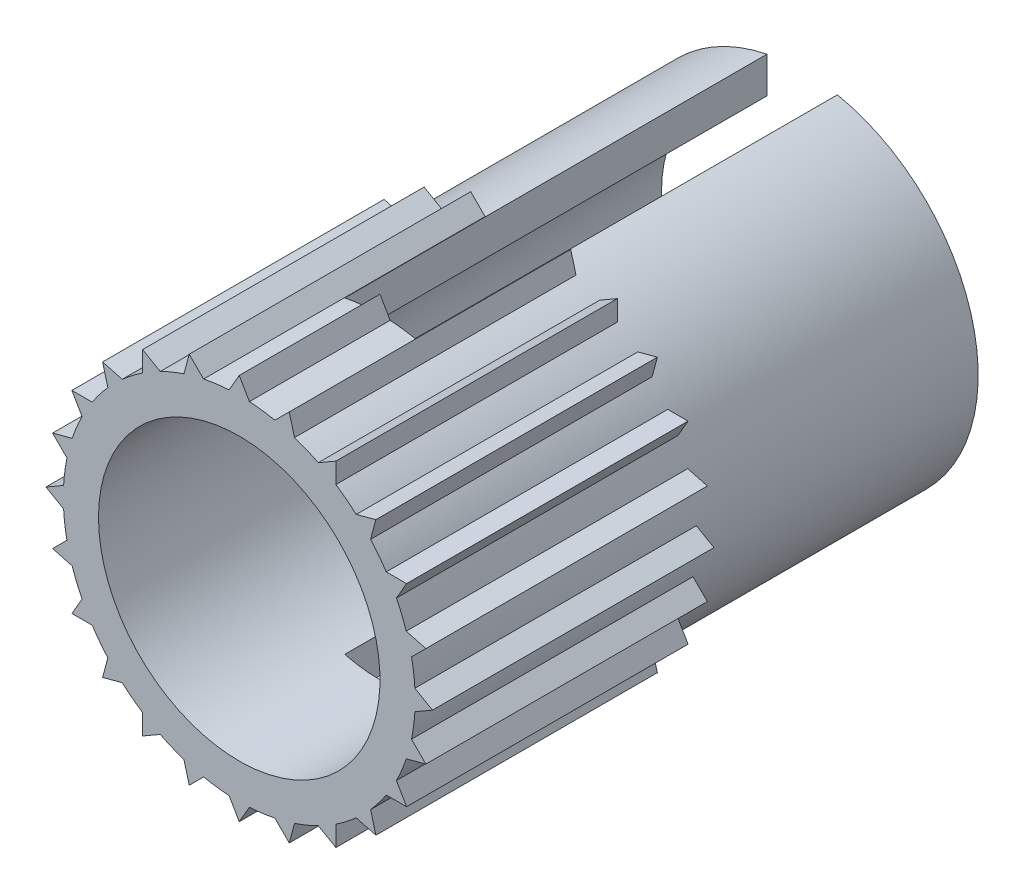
ISO-10303-21;
HEADER;
FILE_DESCRIPTION(('STEP AP214'),'2;1');
FILE_NAME('part.step','',(''),(''),'','','');
FILE_SCHEMA(('AUTOMOTIVE_DESIGN { 1 0 10303 214 1 1 1 1 }'));
ENDSEC;
DATA;
#1=APPLICATION_CONTEXT('core data for automotive mechanical design processes');
#2=APPLICATION_PROTOCOL_DEFINITION('international standard','automotive_design',2000,#1);
#3=PRODUCT_CONTEXT('',#1,'mechanical');
#4=PRODUCT('Part','Part','',(#3));
#5=PRODUCT_RELATED_PRODUCT_CATEGORY('part','',(#4));
#6=PRODUCT_DEFINITION_FORMATION('','',#4);
#7=PRODUCT_DEFINITION_CONTEXT('part definition',#1,'design');
#8=PRODUCT_DEFINITION('design','',#6,#7);
#9=PRODUCT_DEFINITION_SHAPE('','',#8);
#10=(LENGTH_UNIT() NAMED_UNIT(*) SI_UNIT(.MILLI.,.METRE.));
#11=(NAMED_UNIT(*) PLANE_ANGLE_UNIT() SI_UNIT($,.RADIAN.));
#12=(NAMED_UNIT(*) SI_UNIT($,.STERADIAN.) SOLID_ANGLE_UNIT());
#13=UNCERTAINTY_MEASURE_WITH_UNIT(LENGTH_MEASURE(1.E-05),#10,'distance_accuracy_value','');
#14=(GEOMETRIC_REPRESENTATION_CONTEXT(3) GLOBAL_UNCERTAINTY_ASSIGNED_CONTEXT((#13)) GLOBAL_UNIT_ASSIGNED_CONTEXT((#10,
#11,#12)) REPRESENTATION_CONTEXT('',''));
#15=CARTESIAN_POINT('',(0.,0.,0.));
#16=DIRECTION('',(0.,0.,1.));
#17=DIRECTION('',(1.,0.,0.));
#18=AXIS2_PLACEMENT_3D('',#15,#16,#17);
#19=CARTESIAN_POINT('',(-0.144337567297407,-2.49582985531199,0.));
#20=DIRECTION('',(-0.866025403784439,-0.5,0.));
#21=DIRECTION('',(0.5,-0.866025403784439,0.));
#22=AXIS2_PLACEMENT_3D('',#19,#20,#21);
#23=PLANE('',#22);
#24=DIRECTION('',(0.5,-0.866025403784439,0.));
#25=VECTOR('',#24,1.);
#26=CARTESIAN_POINT('',(-0.144337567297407,-2.49582985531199,0.));
#27=LINE('',#26,#25);
#28=CARTESIAN_POINT('',(0.,-2.74582985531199,0.));
#29=VERTEX_POINT('',#28);
#30=CARTESIAN_POINT('',(-0.144337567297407,-2.49582985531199,0.));
#31=VERTEX_POINT('',#30);
#32=EDGE_CURVE('E858',#29,#31,#27,.F.);
#33=ORIENTED_EDGE('',*,*,#32,.T.);
#34=DIRECTION('',(0.,0.,-1.));
#35=VECTOR('',#34,1.);
#36=CARTESIAN_POINT('',(-0.144337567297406,-2.49582985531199,0.));
#37=LINE('',#36,#35);
#38=CARTESIAN_POINT('',(-0.144337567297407,-2.49582985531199,-2.));
#39=VERTEX_POINT('',#38);
#40=EDGE_CURVE('E379',#39,#31,#37,.F.);
#41=ORIENTED_EDGE('',*,*,#40,.F.);
#42=DIRECTION('',(0.5,-0.866025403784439,0.));
#43=VECTOR('',#42,1.);
#44=CARTESIAN_POINT('',(-0.144337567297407,-2.49582985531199,-2.));
#45=LINE('',#44,#43);
#46=CARTESIAN_POINT('',(0.,-2.74582985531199,-2.));
#47=VERTEX_POINT('',#46);
#48=EDGE_CURVE('E375',#39,#47,#45,.T.);
#49=ORIENTED_EDGE('',*,*,#48,.T.);
#50=DIRECTION('',(0.,0.,1.));
#51=VECTOR('',#50,1.);
#52=CARTESIAN_POINT('',(0.,-2.74582985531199,0.));
#53=LINE('',#52,#51);
#54=EDGE_CURVE('E380',#29,#47,#53,.F.);
#55=ORIENTED_EDGE('',*,*,#54,.F.);
#56=EDGE_LOOP('',(#33,#41,#49,#55));
#57=FACE_BOUND('',#56,.T.);
#58=ADVANCED_FACE('F16',(#57),#23,.T.);
#59=CARTESIAN_POINT('',(-0.710673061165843,-2.65226797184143,0.));
#60=DIRECTION('',(0.707106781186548,-0.707106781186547,0.));
#61=DIRECTION('',(0.707106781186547,0.707106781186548,0.));
#62=AXIS2_PLACEMENT_3D('',#59,#60,#61);
#63=PLANE('',#62);
#64=DIRECTION('',(0.707106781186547,0.707106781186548,0.));
#65=VECTOR('',#64,1.);
#66=CARTESIAN_POINT('',(-0.710673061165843,-2.65226797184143,0.));
#67=LINE('',#66,#65);
#68=CARTESIAN_POINT('',(-0.506548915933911,-2.4481438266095,0.));
#69=VERTEX_POINT('',#68);
#70=CARTESIAN_POINT('',(-0.710673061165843,-2.65226797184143,0.));
#71=VERTEX_POINT('',#70);
#72=EDGE_CURVE('E855',#69,#71,#67,.F.);
#73=ORIENTED_EDGE('',*,*,#72,.T.);
#74=DIRECTION('',(0.,0.,1.));
#75=VECTOR('',#74,1.);
#76=CARTESIAN_POINT('',(-0.710673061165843,-2.65226797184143,0.));
#77=LINE('',#76,#75);
#78=CARTESIAN_POINT('',(-0.710673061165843,-2.65226797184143,-4.));
#79=VERTEX_POINT('',#78);
#80=EDGE_CURVE('E848',#79,#71,#77,.T.);
#81=ORIENTED_EDGE('',*,*,#80,.F.);
#82=DIRECTION('',(0.707106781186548,0.707106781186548,0.));
#83=VECTOR('',#82,1.);
#84=CARTESIAN_POINT('',(-0.710673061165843,-2.65226797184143,-4.));
#85=LINE('',#84,#83);
#86=CARTESIAN_POINT('',(-0.506548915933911,-2.4481438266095,-4.));
#87=VERTEX_POINT('',#86);
#88=EDGE_CURVE('E852',#79,#87,#85,.T.);
#89=ORIENTED_EDGE('',*,*,#88,.T.);
#90=DIRECTION('',(0.,0.,-1.));
#91=VECTOR('',#90,1.);
#92=CARTESIAN_POINT('',(-0.506548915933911,-2.44814382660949,0.));
#93=LINE('',#92,#91);
#94=EDGE_CURVE('E514',#69,#87,#93,.T.);
#95=ORIENTED_EDGE('',*,*,#94,.F.);
#96=EDGE_LOOP('',(#73,#81,#89,#95));
#97=FACE_BOUND('',#96,.T.);
#98=ADVANCED_FACE('F1627',(#97),#63,.T.);
#99=CARTESIAN_POINT('',(-0.667748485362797,-2.49207127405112,-4.));
#100=DIRECTION('',(0.,0.,1.));
#101=DIRECTION('',(1.,0.,0.));
#102=AXIS2_PLACEMENT_3D('',#99,#100,#101);
#103=PLANE('',#102);
#104=CARTESIAN_POINT('',(0.,0.,-4.));
#105=DIRECTION('',(0.,0.,-1.));
#106=DIRECTION('',(-1.,0.,0.));
#107=AXIS2_PLACEMENT_3D('',#104,#105,#106);
#108=CIRCLE('',#107,2.5);
#109=CARTESIAN_POINT('',(-0.785387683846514,-2.37342920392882,-4.));
#110=VERTEX_POINT('',#109);
#111=EDGE_CURVE('E511',#87,#110,#108,.T.);
#112=ORIENTED_EDGE('',*,*,#111,.F.);
#113=ORIENTED_EDGE('',*,*,#88,.F.);
#114=DIRECTION('',(0.258819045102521,-0.965925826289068,0.));
#115=VECTOR('',#114,1.);
#116=CARTESIAN_POINT('',(-0.785387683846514,-2.37342920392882,-4.));
#117=LINE('',#116,#115);
#118=EDGE_CURVE('E849',#110,#79,#117,.T.);
#119=ORIENTED_EDGE('',*,*,#118,.F.);
#120=EDGE_LOOP('',(#112,#113,#119));
#121=FACE_BOUND('',#120,.T.);
#122=ADVANCED_FACE('F1021',(#121),#103,.F.);
#123=CARTESIAN_POINT('',(-0.785387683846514,-2.37342920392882,0.));
#124=DIRECTION('',(-0.965925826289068,-0.258819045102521,0.));
#125=DIRECTION('',(0.258819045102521,-0.965925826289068,0.));
#126=AXIS2_PLACEMENT_3D('',#123,#124,#125);
#127=PLANE('',#126);
#128=DIRECTION('',(0.258819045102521,-0.965925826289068,0.));
#129=VECTOR('',#128,1.);
#130=CARTESIAN_POINT('',(-0.785387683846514,-2.37342920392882,0.));
#131=LINE('',#130,#129);
#132=CARTESIAN_POINT('',(-0.785387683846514,-2.37342920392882,0.));
#133=VERTEX_POINT('',#132);
#134=EDGE_CURVE('E846',#71,#133,#131,.F.);
#135=ORIENTED_EDGE('',*,*,#134,.T.);
#136=DIRECTION('',(0.,0.,-1.));
#137=VECTOR('',#136,1.);
#138=CARTESIAN_POINT('',(-0.785387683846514,-2.37342920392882,0.));
#139=LINE('',#138,#137);
#140=EDGE_CURVE('E507',#110,#133,#139,.F.);
#141=ORIENTED_EDGE('',*,*,#140,.F.);
#142=ORIENTED_EDGE('',*,*,#118,.T.);
#143=ORIENTED_EDGE('',*,*,#80,.T.);
#144=EDGE_LOOP('',(#135,#141,#142,#143));
#145=FACE_BOUND('',#144,.T.);
#146=ADVANCED_FACE('F1025',(#145),#127,.T.);
#147=CARTESIAN_POINT('',(-1.372914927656,-2.37795840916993,0.));
#148=DIRECTION('',(0.500000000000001,-0.866025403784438,0.));
#149=DIRECTION('',(0.866025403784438,0.500000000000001,0.));
#150=AXIS2_PLACEMENT_3D('',#147,#148,#149);
#151=PLANE('',#150);
#152=DIRECTION('',(0.866025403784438,0.500000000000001,0.));
#153=VECTOR('',#152,1.);
#154=CARTESIAN_POINT('',(-1.372914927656,-2.37795840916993,0.));
#155=LINE('',#154,#153);
#156=CARTESIAN_POINT('',(-1.122914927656,-2.23362084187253,0.));
#157=VERTEX_POINT('',#156);
#158=CARTESIAN_POINT('',(-1.372914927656,-2.37795840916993,0.));
#159=VERTEX_POINT('',#158);
#160=EDGE_CURVE('E843',#157,#159,#155,.F.);
#161=ORIENTED_EDGE('',*,*,#160,.T.);
#162=DIRECTION('',(0.,0.,1.));
#163=VECTOR('',#162,1.);
#164=CARTESIAN_POINT('',(-1.372914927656,-2.37795840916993,0.));
#165=LINE('',#164,#163);
#166=CARTESIAN_POINT('',(-1.372914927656,-2.37795840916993,-4.));
#167=VERTEX_POINT('',#166);
#168=EDGE_CURVE('E836',#167,#159,#165,.T.);
#169=ORIENTED_EDGE('',*,*,#168,.F.);
#170=DIRECTION('',(0.866025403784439,0.499999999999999,0.));
#171=VECTOR('',#170,1.);
#172=CARTESIAN_POINT('',(-1.372914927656,-2.37795840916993,-4.));
#173=LINE('',#172,#171);
#174=CARTESIAN_POINT('',(-1.122914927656,-2.23362084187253,-4.));
#175=VERTEX_POINT('',#174);
#176=EDGE_CURVE('E840',#167,#175,#173,.T.);
#177=ORIENTED_EDGE('',*,*,#176,.T.);
#178=DIRECTION('',(0.,0.,-1.));
#179=VECTOR('',#178,1.);
#180=CARTESIAN_POINT('',(-1.122914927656,-2.23362084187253,0.));
#181=LINE('',#180,#179);
#182=EDGE_CURVE('E510',#157,#175,#181,.T.);
#183=ORIENTED_EDGE('',*,*,#182,.F.);
#184=EDGE_LOOP('',(#161,#169,#177,#183));
#185=FACE_BOUND('',#184,.T.);
#186=ADVANCED_FACE('F1155',(#185),#151,.T.);
#187=CARTESIAN_POINT('',(-1.28999101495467,-2.23432997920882,-4.));
#188=DIRECTION('',(0.,0.,1.));
#189=DIRECTION('',(1.,0.,0.));
#190=AXIS2_PLACEMENT_3D('',#187,#188,#189);
#191=PLANE('',#190);
#192=CARTESIAN_POINT('',(0.,0.,-4.));
#193=DIRECTION('',(0.,0.,-1.));
#194=DIRECTION('',(-1.,0.,0.));
#195=AXIS2_PLACEMENT_3D('',#192,#193,#194);
#196=CIRCLE('',#195,2.5);
#197=CARTESIAN_POINT('',(-1.372914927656,-2.08928327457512,-4.));
#198=VERTEX_POINT('',#197);
#199=EDGE_CURVE('E505',#175,#198,#196,.T.);
#200=ORIENTED_EDGE('',*,*,#199,.F.);
#201=ORIENTED_EDGE('',*,*,#176,.F.);
#202=DIRECTION('',(0.,1.,0.));
#203=VECTOR('',#202,1.);
#204=CARTESIAN_POINT('',(-1.372914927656,-2.08928327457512,-4.));
#205=LINE('',#204,#203);
#206=EDGE_CURVE('E837',#198,#167,#205,.F.);
#207=ORIENTED_EDGE('',*,*,#206,.F.);
#208=EDGE_LOOP('',(#200,#201,#207));
#209=FACE_BOUND('',#208,.T.);
#210=ADVANCED_FACE('F1166',(#209),#191,.F.);
#211=CARTESIAN_POINT('',(-1.372914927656,-2.08928327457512,0.));
#212=DIRECTION('',(-1.,0.,0.));
#213=DIRECTION('',(0.,0.,1.));
#214=AXIS2_PLACEMENT_3D('',#211,#212,#213);
#215=PLANE('',#214);
#216=DIRECTION('',(0.,1.,0.));
#217=VECTOR('',#216,1.);
#218=CARTESIAN_POINT('',(-1.372914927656,-2.08928327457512,0.));
#219=LINE('',#218,#217);
#220=CARTESIAN_POINT('',(-1.372914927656,-2.08928327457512,0.));
#221=VERTEX_POINT('',#220);
#222=EDGE_CURVE('E834',#159,#221,#219,.T.);
#223=ORIENTED_EDGE('',*,*,#222,.T.);
#224=DIRECTION('',(0.,0.,-1.));
#225=VECTOR('',#224,1.);
#226=CARTESIAN_POINT('',(-1.37291492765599,-2.08928327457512,0.));
#227=LINE('',#226,#225);
#228=EDGE_CURVE('E501',#198,#221,#227,.F.);
#229=ORIENTED_EDGE('',*,*,#228,.F.);
#230=ORIENTED_EDGE('',*,*,#206,.T.);
#231=ORIENTED_EDGE('',*,*,#168,.T.);
#232=EDGE_LOOP('',(#223,#229,#230,#231));
#233=FACE_BOUND('',#232,.T.);
#234=ADVANCED_FACE('F1158',(#233),#215,.T.);
#235=CARTESIAN_POINT('',(-1.94159491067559,-1.94159491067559,0.));
#236=DIRECTION('',(0.258819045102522,-0.965925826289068,0.));
#237=DIRECTION('',(0.965925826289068,0.258819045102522,0.));
#238=AXIS2_PLACEMENT_3D('',#235,#236,#237);
#239=PLANE('',#238);
#240=DIRECTION('',(0.965925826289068,0.258819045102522,0.));
#241=VECTOR('',#240,1.);
#242=CARTESIAN_POINT('',(-1.94159491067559,-1.94159491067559,0.));
#243=LINE('',#242,#241);
#244=CARTESIAN_POINT('',(-1.66275614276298,-1.86688028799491,0.));
#245=VERTEX_POINT('',#244);
#246=CARTESIAN_POINT('',(-1.94159491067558,-1.94159491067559,0.));
#247=VERTEX_POINT('',#246);
#248=EDGE_CURVE('E831',#245,#247,#243,.F.);
#249=ORIENTED_EDGE('',*,*,#248,.T.);
#250=DIRECTION('',(0.,0.,1.));
#251=VECTOR('',#250,1.);
#252=CARTESIAN_POINT('',(-1.94159491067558,-1.94159491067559,0.));
#253=LINE('',#252,#251);
#254=CARTESIAN_POINT('',(-1.94159491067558,-1.94159491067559,-4.));
#255=VERTEX_POINT('',#254);
#256=EDGE_CURVE('E824',#255,#247,#253,.T.);
#257=ORIENTED_EDGE('',*,*,#256,.F.);
#258=DIRECTION('',(0.965925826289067,0.258819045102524,0.));
#259=VECTOR('',#258,1.);
#260=CARTESIAN_POINT('',(-1.94159491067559,-1.94159491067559,-4.));
#261=LINE('',#260,#259);
#262=CARTESIAN_POINT('',(-1.66275614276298,-1.86688028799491,-4.));
#263=VERTEX_POINT('',#262);
#264=EDGE_CURVE('E828',#255,#263,#261,.T.);
#265=ORIENTED_EDGE('',*,*,#264,.T.);
#266=DIRECTION('',(0.,0.,-1.));
#267=VECTOR('',#266,1.);
#268=CARTESIAN_POINT('',(-1.66275614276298,-1.86688028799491,0.));
#269=LINE('',#268,#267);
#270=EDGE_CURVE('E504',#245,#263,#269,.T.);
#271=ORIENTED_EDGE('',*,*,#270,.F.);
#272=EDGE_LOOP('',(#249,#257,#265,#271));
#273=FACE_BOUND('',#272,.T.);
#274=ADVANCED_FACE('F1174',(#273),#239,.T.);
#275=CARTESIAN_POINT('',(-1.82432278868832,-1.82432278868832,-4.));
#276=DIRECTION('',(0.,0.,1.));
#277=DIRECTION('',(1.,0.,0.));
#278=AXIS2_PLACEMENT_3D('',#275,#276,#277);
#279=PLANE('',#278);
#280=CARTESIAN_POINT('',(0.,0.,-4.));
#281=DIRECTION('',(0.,0.,-1.));
#282=DIRECTION('',(-1.,0.,0.));
#283=AXIS2_PLACEMENT_3D('',#280,#281,#282);
#284=CIRCLE('',#283,2.5);
#285=CARTESIAN_POINT('',(-1.86688028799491,-1.66275614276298,-4.));
#286=VERTEX_POINT('',#285);
#287=EDGE_CURVE('E499',#263,#286,#284,.T.);
#288=ORIENTED_EDGE('',*,*,#287,.F.);
#289=ORIENTED_EDGE('',*,*,#264,.F.);
#290=DIRECTION('',(-0.258819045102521,-0.965925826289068,0.));
#291=VECTOR('',#290,1.);
#292=CARTESIAN_POINT('',(-1.86688028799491,-1.66275614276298,-4.));
#293=LINE('',#292,#291);
#294=EDGE_CURVE('E825',#286,#255,#293,.T.);
#295=ORIENTED_EDGE('',*,*,#294,.F.);
#296=EDGE_LOOP('',(#288,#289,#295));
#297=FACE_BOUND('',#296,.T.);
#298=ADVANCED_FACE('F1463',(#297),#279,.F.);
#299=CARTESIAN_POINT('',(-1.86688028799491,-1.66275614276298,0.));
#300=DIRECTION('',(-0.965925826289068,0.258819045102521,0.));
#301=DIRECTION('',(-0.258819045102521,-0.965925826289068,0.));
#302=AXIS2_PLACEMENT_3D('',#299,#300,#301);
#303=PLANE('',#302);
#304=DIRECTION('',(-0.258819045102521,-0.965925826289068,0.));
#305=VECTOR('',#304,1.);
#306=CARTESIAN_POINT('',(-1.86688028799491,-1.66275614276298,0.));
#307=LINE('',#306,#305);
#308=CARTESIAN_POINT('',(-1.86688028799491,-1.66275614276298,0.));
#309=VERTEX_POINT('',#308);
#310=EDGE_CURVE('E822',#247,#309,#307,.F.);
#311=ORIENTED_EDGE('',*,*,#310,.T.);
#312=DIRECTION('',(0.,0.,-1.));
#313=VECTOR('',#312,1.);
#314=CARTESIAN_POINT('',(-1.86688028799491,-1.66275614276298,0.));
#315=LINE('',#314,#313);
#316=EDGE_CURVE('E495',#286,#309,#315,.F.);
#317=ORIENTED_EDGE('',*,*,#316,.F.);
#318=ORIENTED_EDGE('',*,*,#294,.T.);
#319=ORIENTED_EDGE('',*,*,#256,.T.);
#320=EDGE_LOOP('',(#311,#317,#318,#319));
#321=FACE_BOUND('',#320,.T.);
#322=ADVANCED_FACE('F1459',(#321),#303,.T.);
#323=CARTESIAN_POINT('',(-2.37795840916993,-1.372914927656,0.));
#324=DIRECTION('',(0.,-1.,0.));
#325=DIRECTION('',(0.,0.,-1.));
#326=AXIS2_PLACEMENT_3D('',#323,#324,#325);
#327=PLANE('',#326);
#328=DIRECTION('',(1.,0.,0.));
#329=VECTOR('',#328,1.);
#330=CARTESIAN_POINT('',(-2.37795840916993,-1.372914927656,0.));
#331=LINE('',#330,#329);
#332=CARTESIAN_POINT('',(-2.08928327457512,-1.37291492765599,0.));
#333=VERTEX_POINT('',#332);
#334=CARTESIAN_POINT('',(-2.37795840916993,-1.37291492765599,0.));
#335=VERTEX_POINT('',#334);
#336=EDGE_CURVE('E819',#333,#335,#331,.F.);
#337=ORIENTED_EDGE('',*,*,#336,.T.);
#338=DIRECTION('',(0.,0.,1.));
#339=VECTOR('',#338,1.);
#340=CARTESIAN_POINT('',(-2.37795840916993,-1.37291492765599,0.));
#341=LINE('',#340,#339);
#342=CARTESIAN_POINT('',(-2.37795840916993,-1.37291492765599,-4.));
#343=VERTEX_POINT('',#342);
#344=EDGE_CURVE('E812',#343,#335,#341,.T.);
#345=ORIENTED_EDGE('',*,*,#344,.F.);
#346=DIRECTION('',(1.,0.,0.));
#347=VECTOR('',#346,1.);
#348=CARTESIAN_POINT('',(-2.23432997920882,-1.372914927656,-4.));
#349=LINE('',#348,#347);
#350=CARTESIAN_POINT('',(-2.08928327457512,-1.37291492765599,-4.));
#351=VERTEX_POINT('',#350);
#352=EDGE_CURVE('E816',#343,#351,#349,.T.);
#353=ORIENTED_EDGE('',*,*,#352,.T.);
#354=DIRECTION('',(0.,0.,-1.));
#355=VECTOR('',#354,1.);
#356=CARTESIAN_POINT('',(-2.08928327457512,-1.37291492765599,0.));
#357=LINE('',#356,#355);
#358=EDGE_CURVE('E498',#333,#351,#357,.T.);
#359=ORIENTED_EDGE('',*,*,#358,.F.);
#360=EDGE_LOOP('',(#337,#345,#353,#359));
#361=FACE_BOUND('',#360,.T.);
#362=ADVANCED_FACE('F1455',(#361),#327,.T.);
#363=CARTESIAN_POINT('',(-2.23432997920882,-1.28999101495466,-4.));
#364=DIRECTION('',(0.,0.,1.));
#365=DIRECTION('',(1.,0.,0.));
#366=AXIS2_PLACEMENT_3D('',#363,#364,#365);
#367=PLANE('',#366);
#368=CARTESIAN_POINT('',(0.,0.,-4.));
#369=DIRECTION('',(0.,0.,-1.));
#370=DIRECTION('',(-1.,0.,0.));
#371=AXIS2_PLACEMENT_3D('',#368,#369,#370);
#372=CIRCLE('',#371,2.5);
#373=CARTESIAN_POINT('',(-2.23362084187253,-1.12291492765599,-4.));
#374=VERTEX_POINT('',#373);
#375=EDGE_CURVE('E493',#351,#374,#372,.T.);
#376=ORIENTED_EDGE('',*,*,#375,.F.);
#377=ORIENTED_EDGE('',*,*,#352,.F.);
#378=DIRECTION('',(-0.5,-0.866025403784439,0.));
#379=VECTOR('',#378,1.);
#380=CARTESIAN_POINT('',(-2.23362084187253,-1.12291492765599,-4.));
#381=LINE('',#380,#379);
#382=EDGE_CURVE('E813',#374,#343,#381,.T.);
#383=ORIENTED_EDGE('',*,*,#382,.F.);
#384=EDGE_LOOP('',(#376,#377,#383));
#385=FACE_BOUND('',#384,.T.);
#386=ADVANCED_FACE('F1451',(#385),#367,.F.);
#387=CARTESIAN_POINT('',(-2.23362084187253,-1.12291492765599,0.));
#388=DIRECTION('',(-0.866025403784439,0.5,0.));
#389=DIRECTION('',(-0.5,-0.866025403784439,0.));
#390=AXIS2_PLACEMENT_3D('',#387,#388,#389);
#391=PLANE('',#390);
#392=DIRECTION('',(-0.5,-0.866025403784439,0.));
#393=VECTOR('',#392,1.);
#394=CARTESIAN_POINT('',(-2.23362084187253,-1.12291492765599,0.));
#395=LINE('',#394,#393);
#396=CARTESIAN_POINT('',(-2.23362084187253,-1.12291492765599,0.));
#397=VERTEX_POINT('',#396);
#398=EDGE_CURVE('E810',#335,#397,#395,.F.);
#399=ORIENTED_EDGE('',*,*,#398,.T.);
#400=DIRECTION('',(0.,0.,-1.));
#401=VECTOR('',#400,1.);
#402=CARTESIAN_POINT('',(-2.23362084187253,-1.12291492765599,0.));
#403=LINE('',#402,#401);
#404=EDGE_CURVE('E489',#374,#397,#403,.F.);
#405=ORIENTED_EDGE('',*,*,#404,.F.);
#406=ORIENTED_EDGE('',*,*,#382,.T.);
#407=ORIENTED_EDGE('',*,*,#344,.T.);
#408=EDGE_LOOP('',(#399,#405,#406,#407));
#409=FACE_BOUND('',#408,.T.);
#410=ADVANCED_FACE('F1447',(#409),#391,.T.);
#411=CARTESIAN_POINT('',(-2.65226797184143,-0.710673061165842,0.));
#412=DIRECTION('',(-0.25881904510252,-0.965925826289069,0.));
#413=DIRECTION('',(0.965925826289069,-0.25881904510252,0.));
#414=AXIS2_PLACEMENT_3D('',#411,#412,#413);
#415=PLANE('',#414);
#416=DIRECTION('',(0.965925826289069,-0.25881904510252,0.));
#417=VECTOR('',#416,1.);
#418=CARTESIAN_POINT('',(-2.65226797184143,-0.710673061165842,0.));
#419=LINE('',#418,#417);
#420=CARTESIAN_POINT('',(-2.37342920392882,-0.785387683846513,0.));
#421=VERTEX_POINT('',#420);
#422=CARTESIAN_POINT('',(-2.65226797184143,-0.710673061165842,0.));
#423=VERTEX_POINT('',#422);
#424=EDGE_CURVE('E807',#421,#423,#419,.F.);
#425=ORIENTED_EDGE('',*,*,#424,.T.);
#426=DIRECTION('',(0.,0.,1.));
#427=VECTOR('',#426,1.);
#428=CARTESIAN_POINT('',(-2.65226797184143,-0.710673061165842,0.));
#429=LINE('',#428,#427);
#430=CARTESIAN_POINT('',(-2.65226797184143,-0.710673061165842,-4.));
#431=VERTEX_POINT('',#430);
#432=EDGE_CURVE('E800',#431,#423,#429,.T.);
#433=ORIENTED_EDGE('',*,*,#432,.F.);
#434=DIRECTION('',(0.965925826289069,-0.258819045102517,0.));
#435=VECTOR('',#434,1.);
#436=CARTESIAN_POINT('',(-2.65226797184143,-0.710673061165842,-4.));
#437=LINE('',#436,#435);
#438=CARTESIAN_POINT('',(-2.37342920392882,-0.785387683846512,-4.));
#439=VERTEX_POINT('',#438);
#440=EDGE_CURVE('E804',#431,#439,#437,.T.);
#441=ORIENTED_EDGE('',*,*,#440,.T.);
#442=DIRECTION('',(0.,0.,-1.));
#443=VECTOR('',#442,1.);
#444=CARTESIAN_POINT('',(-2.37342920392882,-0.785387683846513,0.));
#445=LINE('',#444,#443);
#446=EDGE_CURVE('E492',#421,#439,#445,.T.);
#447=ORIENTED_EDGE('',*,*,#446,.F.);
#448=EDGE_LOOP('',(#425,#433,#441,#447));
#449=FACE_BOUND('',#448,.T.);
#450=ADVANCED_FACE('F1443',(#449),#415,.T.);
#451=CARTESIAN_POINT('',(-2.49207127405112,-0.667748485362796,-4.));
#452=DIRECTION('',(0.,0.,1.));
#453=DIRECTION('',(1.,0.,0.));
#454=AXIS2_PLACEMENT_3D('',#451,#452,#453);
#455=PLANE('',#454);
#456=CARTESIAN_POINT('',(0.,0.,-4.));
#457=DIRECTION('',(0.,0.,-1.));
#458=DIRECTION('',(-1.,0.,0.));
#459=AXIS2_PLACEMENT_3D('',#456,#457,#458);
#460=CIRCLE('',#459,2.5);
#461=CARTESIAN_POINT('',(-2.4481438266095,-0.50654891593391,-4.));
#462=VERTEX_POINT('',#461);
#463=EDGE_CURVE('E487',#439,#462,#460,.T.);
#464=ORIENTED_EDGE('',*,*,#463,.F.);
#465=ORIENTED_EDGE('',*,*,#440,.F.);
#466=DIRECTION('',(-0.707106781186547,-0.707106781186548,0.));
#467=VECTOR('',#466,1.);
#468=CARTESIAN_POINT('',(-2.4481438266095,-0.50654891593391,-4.));
#469=LINE('',#468,#467);
#470=EDGE_CURVE('E801',#462,#431,#469,.T.);
#471=ORIENTED_EDGE('',*,*,#470,.F.);
#472=EDGE_LOOP('',(#464,#465,#471));
#473=FACE_BOUND('',#472,.T.);
#474=ADVANCED_FACE('F1439',(#473),#455,.F.);
#475=CARTESIAN_POINT('',(-2.4481438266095,-0.50654891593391,0.));
#476=DIRECTION('',(-0.707106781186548,0.707106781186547,0.));
#477=DIRECTION('',(-0.707106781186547,-0.707106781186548,0.));
#478=AXIS2_PLACEMENT_3D('',#475,#476,#477);
#479=PLANE('',#478);
#480=DIRECTION('',(-0.707106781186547,-0.707106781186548,0.));
#481=VECTOR('',#480,1.);
#482=CARTESIAN_POINT('',(-2.4481438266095,-0.50654891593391,0.));
#483=LINE('',#482,#481);
#484=CARTESIAN_POINT('',(-2.4481438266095,-0.50654891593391,0.));
#485=VERTEX_POINT('',#484);
#486=EDGE_CURVE('E798',#423,#485,#483,.F.);
#487=ORIENTED_EDGE('',*,*,#486,.T.);
#488=DIRECTION('',(0.,0.,-1.));
#489=VECTOR('',#488,1.);
#490=CARTESIAN_POINT('',(-2.4481438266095,-0.50654891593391,0.));
#491=LINE('',#490,#489);
#492=EDGE_CURVE('E483',#462,#485,#491,.F.);
#493=ORIENTED_EDGE('',*,*,#492,.F.);
#494=ORIENTED_EDGE('',*,*,#470,.T.);
#495=ORIENTED_EDGE('',*,*,#432,.T.);
#496=EDGE_LOOP('',(#487,#493,#494,#495));
#497=FACE_BOUND('',#496,.T.);
#498=ADVANCED_FACE('F1435',(#497),#479,.T.);
#499=CARTESIAN_POINT('',(-2.74582985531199,0.,0.));
#500=DIRECTION('',(-0.499999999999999,-0.866025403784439,0.));
#501=DIRECTION('',(0.866025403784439,-0.499999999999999,0.));
#502=AXIS2_PLACEMENT_3D('',#499,#500,#501);
#503=PLANE('',#502);
#504=DIRECTION('',(0.866025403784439,-0.499999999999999,0.));
#505=VECTOR('',#504,1.);
#506=CARTESIAN_POINT('',(-2.74582985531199,0.,0.));
#507=LINE('',#506,#505);
#508=CARTESIAN_POINT('',(-2.49582985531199,-0.144337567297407,0.));
#509=VERTEX_POINT('',#508);
#510=CARTESIAN_POINT('',(-2.74582985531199,0.,0.));
#511=VERTEX_POINT('',#510);
#512=EDGE_CURVE('E795',#509,#511,#507,.F.);
#513=ORIENTED_EDGE('',*,*,#512,.T.);
#514=DIRECTION('',(0.,0.,1.));
#515=VECTOR('',#514,1.);
#516=CARTESIAN_POINT('',(-2.74582985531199,0.,0.));
#517=LINE('',#516,#515);
#518=CARTESIAN_POINT('',(-2.74582985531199,0.,-4.));
#519=VERTEX_POINT('',#518);
#520=EDGE_CURVE('E788',#519,#511,#517,.T.);
#521=ORIENTED_EDGE('',*,*,#520,.F.);
#522=DIRECTION('',(0.866025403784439,-0.499999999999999,0.));
#523=VECTOR('',#522,1.);
#524=CARTESIAN_POINT('',(-2.74582985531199,0.,-4.));
#525=LINE('',#524,#523);
#526=CARTESIAN_POINT('',(-2.49582985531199,-0.144337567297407,-4.));
#527=VERTEX_POINT('',#526);
#528=EDGE_CURVE('E792',#519,#527,#525,.T.);
#529=ORIENTED_EDGE('',*,*,#528,.T.);
#530=DIRECTION('',(0.,0.,-1.));
#531=VECTOR('',#530,1.);
#532=CARTESIAN_POINT('',(-2.49582985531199,-0.144337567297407,0.));
#533=LINE('',#532,#531);
#534=EDGE_CURVE('E486',#509,#527,#533,.T.);
#535=ORIENTED_EDGE('',*,*,#534,.F.);
#536=EDGE_LOOP('',(#513,#521,#529,#535));
#537=FACE_BOUND('',#536,.T.);
#538=ADVANCED_FACE('F1431',(#537),#503,.T.);
#539=CARTESIAN_POINT('',(-2.57998202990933,0.,-4.));
#540=DIRECTION('',(0.,0.,1.));
#541=DIRECTION('',(1.,0.,0.));
#542=AXIS2_PLACEMENT_3D('',#539,#540,#541);
#543=PLANE('',#542);
#544=CARTESIAN_POINT('',(0.,0.,-4.));
#545=DIRECTION('',(0.,0.,-1.));
#546=DIRECTION('',(-1.,0.,0.));
#547=AXIS2_PLACEMENT_3D('',#544,#545,#546);
#548=CIRCLE('',#547,2.5);
#549=CARTESIAN_POINT('',(-2.49582985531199,0.144337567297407,-4.));
#550=VERTEX_POINT('',#549);
#551=EDGE_CURVE('E481',#527,#550,#548,.T.);
#552=ORIENTED_EDGE('',*,*,#551,.F.);
#553=ORIENTED_EDGE('',*,*,#528,.F.);
#554=DIRECTION('',(-0.866025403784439,-0.5,0.));
#555=VECTOR('',#554,1.);
#556=CARTESIAN_POINT('',(-2.49582985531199,0.144337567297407,-4.));
#557=LINE('',#556,#555);
#558=EDGE_CURVE('E789',#550,#519,#557,.T.);
#559=ORIENTED_EDGE('',*,*,#558,.F.);
#560=EDGE_LOOP('',(#552,#553,#559));
#561=FACE_BOUND('',#560,.T.);
#562=ADVANCED_FACE('F1427',(#561),#543,.F.);
#563=CARTESIAN_POINT('',(-2.49582985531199,0.144337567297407,0.));
#564=DIRECTION('',(-0.5,0.866025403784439,0.));
#565=DIRECTION('',(-0.866025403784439,-0.5,0.));
#566=AXIS2_PLACEMENT_3D('',#563,#564,#565);
#567=PLANE('',#566);
#568=DIRECTION('',(-0.866025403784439,-0.5,0.));
#569=VECTOR('',#568,1.);
#570=CARTESIAN_POINT('',(-2.49582985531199,0.144337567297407,0.));
#571=LINE('',#570,#569);
#572=CARTESIAN_POINT('',(-2.49582985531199,0.144337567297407,0.));
#573=VERTEX_POINT('',#572);
#574=EDGE_CURVE('E786',#511,#573,#571,.F.);
#575=ORIENTED_EDGE('',*,*,#574,.T.);
#576=DIRECTION('',(0.,0.,-1.));
#577=VECTOR('',#576,1.);
#578=CARTESIAN_POINT('',(-2.49582985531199,0.144337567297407,0.));
#579=LINE('',#578,#577);
#580=EDGE_CURVE('E477',#550,#573,#579,.F.);
#581=ORIENTED_EDGE('',*,*,#580,.F.);
#582=ORIENTED_EDGE('',*,*,#558,.T.);
#583=ORIENTED_EDGE('',*,*,#520,.T.);
#584=EDGE_LOOP('',(#575,#581,#582,#583));
#585=FACE_BOUND('',#584,.T.);
#586=ADVANCED_FACE('F1423',(#585),#567,.T.);
#587=CARTESIAN_POINT('',(-2.65226797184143,0.710673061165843,0.));
#588=DIRECTION('',(-0.707106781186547,-0.707106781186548,0.));
#589=DIRECTION('',(0.707106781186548,-0.707106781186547,0.));
#590=AXIS2_PLACEMENT_3D('',#587,#588,#589);
#591=PLANE('',#590);
#592=DIRECTION('',(0.707106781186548,-0.707106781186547,0.));
#593=VECTOR('',#592,1.);
#594=CARTESIAN_POINT('',(-2.65226797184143,0.710673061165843,0.));
#595=LINE('',#594,#593);
#596=CARTESIAN_POINT('',(-2.44814382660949,0.506548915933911,0.));
#597=VERTEX_POINT('',#596);
#598=CARTESIAN_POINT('',(-2.65226797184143,0.710673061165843,0.));
#599=VERTEX_POINT('',#598);
#600=EDGE_CURVE('E783',#597,#599,#595,.F.);
#601=ORIENTED_EDGE('',*,*,#600,.T.);
#602=DIRECTION('',(0.,0.,1.));
#603=VECTOR('',#602,1.);
#604=CARTESIAN_POINT('',(-2.65226797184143,0.710673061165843,0.));
#605=LINE('',#604,#603);
#606=CARTESIAN_POINT('',(-2.65226797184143,0.710673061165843,-4.));
#607=VERTEX_POINT('',#606);
#608=EDGE_CURVE('E776',#607,#599,#605,.T.);
#609=ORIENTED_EDGE('',*,*,#608,.F.);
#610=DIRECTION('',(0.707106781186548,-0.707106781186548,0.));
#611=VECTOR('',#610,1.);
#612=CARTESIAN_POINT('',(-2.65226797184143,0.710673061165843,-4.));
#613=LINE('',#612,#611);
#614=CARTESIAN_POINT('',(-2.4481438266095,0.506548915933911,-4.));
#615=VERTEX_POINT('',#614);
#616=EDGE_CURVE('E780',#607,#615,#613,.T.);
#617=ORIENTED_EDGE('',*,*,#616,.T.);
#618=DIRECTION('',(0.,0.,-1.));
#619=VECTOR('',#618,1.);
#620=CARTESIAN_POINT('',(-2.44814382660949,0.506548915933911,0.));
#621=LINE('',#620,#619);
#622=EDGE_CURVE('E480',#597,#615,#621,.T.);
#623=ORIENTED_EDGE('',*,*,#622,.F.);
#624=EDGE_LOOP('',(#601,#609,#617,#623));
#625=FACE_BOUND('',#624,.T.);
#626=ADVANCED_FACE('F1419',(#625),#591,.T.);
#627=CARTESIAN_POINT('',(-2.49207127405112,0.667748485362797,-4.));
#628=DIRECTION('',(0.,0.,1.));
#629=DIRECTION('',(1.,0.,0.));
#630=AXIS2_PLACEMENT_3D('',#627,#628,#629);
#631=PLANE('',#630);
#632=CARTESIAN_POINT('',(0.,0.,-4.));
#633=DIRECTION('',(0.,0.,-1.));
#634=DIRECTION('',(-1.,0.,0.));
#635=AXIS2_PLACEMENT_3D('',#632,#633,#634);
#636=CIRCLE('',#635,2.5);
#637=CARTESIAN_POINT('',(-2.37342920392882,0.785387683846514,-4.));
#638=VERTEX_POINT('',#637);
#639=EDGE_CURVE('E475',#615,#638,#636,.T.);
#640=ORIENTED_EDGE('',*,*,#639,.F.);
#641=ORIENTED_EDGE('',*,*,#616,.F.);
#642=DIRECTION('',(-0.965925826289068,-0.258819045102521,0.));
#643=VECTOR('',#642,1.);
#644=CARTESIAN_POINT('',(-2.37342920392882,0.785387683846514,-4.));
#645=LINE('',#644,#643);
#646=EDGE_CURVE('E777',#638,#607,#645,.T.);
#647=ORIENTED_EDGE('',*,*,#646,.F.);
#648=EDGE_LOOP('',(#640,#641,#647));
#649=FACE_BOUND('',#648,.T.);
#650=ADVANCED_FACE('F1415',(#649),#631,.F.);
#651=CARTESIAN_POINT('',(-2.37342920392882,0.785387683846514,0.));
#652=DIRECTION('',(-0.258819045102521,0.965925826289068,0.));
#653=DIRECTION('',(-0.965925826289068,-0.258819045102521,0.));
#654=AXIS2_PLACEMENT_3D('',#651,#652,#653);
#655=PLANE('',#654);
#656=DIRECTION('',(-0.965925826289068,-0.258819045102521,0.));
#657=VECTOR('',#656,1.);
#658=CARTESIAN_POINT('',(-2.37342920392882,0.785387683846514,0.));
#659=LINE('',#658,#657);
#660=CARTESIAN_POINT('',(-2.37342920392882,0.785387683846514,0.));
#661=VERTEX_POINT('',#660);
#662=EDGE_CURVE('E774',#599,#661,#659,.F.);
#663=ORIENTED_EDGE('',*,*,#662,.T.);
#664=DIRECTION('',(0.,0.,-1.));
#665=VECTOR('',#664,1.);
#666=CARTESIAN_POINT('',(-2.37342920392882,0.785387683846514,0.));
#667=LINE('',#666,#665);
#668=EDGE_CURVE('E471',#638,#661,#667,.F.);
#669=ORIENTED_EDGE('',*,*,#668,.F.);
#670=ORIENTED_EDGE('',*,*,#646,.T.);
#671=ORIENTED_EDGE('',*,*,#608,.T.);
#672=EDGE_LOOP('',(#663,#669,#670,#671));
#673=FACE_BOUND('',#672,.T.);
#674=ADVANCED_FACE('F1411',(#673),#655,.T.);
#675=CARTESIAN_POINT('',(-2.37795840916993,1.372914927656,0.));
#676=DIRECTION('',(-0.866025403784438,-0.500000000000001,0.));
#677=DIRECTION('',(0.500000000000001,-0.866025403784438,0.));
#678=AXIS2_PLACEMENT_3D('',#675,#676,#677);
#679=PLANE('',#678);
#680=DIRECTION('',(0.500000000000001,-0.866025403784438,0.));
#681=VECTOR('',#680,1.);
#682=CARTESIAN_POINT('',(-2.37795840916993,1.372914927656,0.));
#683=LINE('',#682,#681);
#684=CARTESIAN_POINT('',(-2.23362084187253,1.122914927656,0.));
#685=VERTEX_POINT('',#684);
#686=CARTESIAN_POINT('',(-2.37795840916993,1.372914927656,0.));
#687=VERTEX_POINT('',#686);
#688=EDGE_CURVE('E771',#685,#687,#683,.F.);
#689=ORIENTED_EDGE('',*,*,#688,.T.);
#690=DIRECTION('',(0.,0.,1.));
#691=VECTOR('',#690,1.);
#692=CARTESIAN_POINT('',(-2.37795840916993,1.372914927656,0.));
#693=LINE('',#692,#691);
#694=CARTESIAN_POINT('',(-2.37795840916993,1.372914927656,-4.));
#695=VERTEX_POINT('',#694);
#696=EDGE_CURVE('E764',#695,#687,#693,.T.);
#697=ORIENTED_EDGE('',*,*,#696,.F.);
#698=DIRECTION('',(0.500000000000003,-0.866025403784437,0.));
#699=VECTOR('',#698,1.);
#700=CARTESIAN_POINT('',(-2.37795840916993,1.372914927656,-4.));
#701=LINE('',#700,#699);
#702=CARTESIAN_POINT('',(-2.23362084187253,1.122914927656,-4.));
#703=VERTEX_POINT('',#702);
#704=EDGE_CURVE('E768',#695,#703,#701,.T.);
#705=ORIENTED_EDGE('',*,*,#704,.T.);
#706=DIRECTION('',(0.,0.,-1.));
#707=VECTOR('',#706,1.);
#708=CARTESIAN_POINT('',(-2.23362084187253,1.122914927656,0.));
#709=LINE('',#708,#707);
#710=EDGE_CURVE('E474',#685,#703,#709,.T.);
#711=ORIENTED_EDGE('',*,*,#710,.F.);
#712=EDGE_LOOP('',(#689,#697,#705,#711));
#713=FACE_BOUND('',#712,.T.);
#714=ADVANCED_FACE('F1407',(#713),#679,.T.);
#715=CARTESIAN_POINT('',(-2.23432997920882,1.28999101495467,-4.));
#716=DIRECTION('',(0.,0.,1.));
#717=DIRECTION('',(1.,0.,0.));
#718=AXIS2_PLACEMENT_3D('',#715,#716,#717);
#719=PLANE('',#718);
#720=CARTESIAN_POINT('',(0.,0.,-4.));
#721=DIRECTION('',(0.,0.,-1.));
#722=DIRECTION('',(-1.,0.,0.));
#723=AXIS2_PLACEMENT_3D('',#720,#721,#722);
#724=CIRCLE('',#723,2.5);
#725=CARTESIAN_POINT('',(-2.08928327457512,1.37291492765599,-4.));
#726=VERTEX_POINT('',#725);
#727=EDGE_CURVE('E469',#703,#726,#724,.T.);
#728=ORIENTED_EDGE('',*,*,#727,.F.);
#729=ORIENTED_EDGE('',*,*,#704,.F.);
#730=DIRECTION('',(1.,0.,0.));
#731=VECTOR('',#730,1.);
#732=CARTESIAN_POINT('',(-2.08928327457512,1.372914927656,-4.));
#733=LINE('',#732,#731);
#734=EDGE_CURVE('E765',#726,#695,#733,.F.);
#735=ORIENTED_EDGE('',*,*,#734,.F.);
#736=EDGE_LOOP('',(#728,#729,#735));
#737=FACE_BOUND('',#736,.T.);
#738=ADVANCED_FACE('F1403',(#737),#719,.F.);
#739=CARTESIAN_POINT('',(-2.08928327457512,1.372914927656,0.));
#740=DIRECTION('',(0.,1.,0.));
#741=DIRECTION('',(0.,0.,1.));
#742=AXIS2_PLACEMENT_3D('',#739,#740,#741);
#743=PLANE('',#742);
#744=DIRECTION('',(1.,0.,0.));
#745=VECTOR('',#744,1.);
#746=CARTESIAN_POINT('',(-2.08928327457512,1.372914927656,0.));
#747=LINE('',#746,#745);
#748=CARTESIAN_POINT('',(-2.08928327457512,1.37291492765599,0.));
#749=VERTEX_POINT('',#748);
#750=EDGE_CURVE('E762',#687,#749,#747,.T.);
#751=ORIENTED_EDGE('',*,*,#750,.T.);
#752=DIRECTION('',(0.,0.,-1.));
#753=VECTOR('',#752,1.);
#754=CARTESIAN_POINT('',(-2.08928327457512,1.37291492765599,0.));
#755=LINE('',#754,#753);
#756=EDGE_CURVE('E465',#726,#749,#755,.F.);
#757=ORIENTED_EDGE('',*,*,#756,.F.);
#758=ORIENTED_EDGE('',*,*,#734,.T.);
#759=ORIENTED_EDGE('',*,*,#696,.T.);
#760=EDGE_LOOP('',(#751,#757,#758,#759));
#761=FACE_BOUND('',#760,.T.);
#762=ADVANCED_FACE('F1399',(#761),#743,.T.);
#763=CARTESIAN_POINT('',(-1.94159491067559,1.94159491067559,0.));
#764=DIRECTION('',(-0.965925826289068,-0.258819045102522,0.));
#765=DIRECTION('',(0.258819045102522,-0.965925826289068,0.));
#766=AXIS2_PLACEMENT_3D('',#763,#764,#765);
#767=PLANE('',#766);
#768=DIRECTION('',(0.258819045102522,-0.965925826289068,0.));
#769=VECTOR('',#768,1.);
#770=CARTESIAN_POINT('',(-1.94159491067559,1.94159491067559,0.));
#771=LINE('',#770,#769);
#772=CARTESIAN_POINT('',(-1.86688028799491,1.66275614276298,0.));
#773=VERTEX_POINT('',#772);
#774=CARTESIAN_POINT('',(-1.94159491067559,1.94159491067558,0.));
#775=VERTEX_POINT('',#774);
#776=EDGE_CURVE('E759',#773,#775,#771,.F.);
#777=ORIENTED_EDGE('',*,*,#776,.T.);
#778=DIRECTION('',(0.,0.,1.));
#779=VECTOR('',#778,1.);
#780=CARTESIAN_POINT('',(-1.94159491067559,1.94159491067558,0.));
#781=LINE('',#780,#779);
#782=CARTESIAN_POINT('',(-1.94159491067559,1.94159491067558,-4.));
#783=VERTEX_POINT('',#782);
#784=EDGE_CURVE('E752',#783,#775,#781,.T.);
#785=ORIENTED_EDGE('',*,*,#784,.F.);
#786=DIRECTION('',(0.258819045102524,-0.965925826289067,0.));
#787=VECTOR('',#786,1.);
#788=CARTESIAN_POINT('',(-1.94159491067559,1.94159491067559,-4.));
#789=LINE('',#788,#787);
#790=CARTESIAN_POINT('',(-1.86688028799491,1.66275614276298,-4.));
#791=VERTEX_POINT('',#790);
#792=EDGE_CURVE('E756',#783,#791,#789,.T.);
#793=ORIENTED_EDGE('',*,*,#792,.T.);
#794=DIRECTION('',(0.,0.,-1.));
#795=VECTOR('',#794,1.);
#796=CARTESIAN_POINT('',(-1.86688028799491,1.66275614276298,0.));
#797=LINE('',#796,#795);
#798=EDGE_CURVE('E468',#773,#791,#797,.T.);
#799=ORIENTED_EDGE('',*,*,#798,.F.);
#800=EDGE_LOOP('',(#777,#785,#793,#799));
#801=FACE_BOUND('',#800,.T.);
#802=ADVANCED_FACE('F1395',(#801),#767,.T.);
#803=CARTESIAN_POINT('',(-1.82432278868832,1.82432278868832,-4.));
#804=DIRECTION('',(0.,0.,1.));
#805=DIRECTION('',(1.,0.,0.));
#806=AXIS2_PLACEMENT_3D('',#803,#804,#805);
#807=PLANE('',#806);
#808=CARTESIAN_POINT('',(0.,0.,-4.));
#809=DIRECTION('',(0.,0.,-1.));
#810=DIRECTION('',(-1.,0.,0.));
#811=AXIS2_PLACEMENT_3D('',#808,#809,#810);
#812=CIRCLE('',#811,2.5);
#813=CARTESIAN_POINT('',(-1.66275614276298,1.86688028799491,-4.));
#814=VERTEX_POINT('',#813);
#815=EDGE_CURVE('E463',#791,#814,#812,.T.);
#816=ORIENTED_EDGE('',*,*,#815,.F.);
#817=ORIENTED_EDGE('',*,*,#792,.F.);
#818=DIRECTION('',(-0.965925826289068,0.258819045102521,0.));
#819=VECTOR('',#818,1.);
#820=CARTESIAN_POINT('',(-1.66275614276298,1.86688028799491,-4.));
#821=LINE('',#820,#819);
#822=EDGE_CURVE('E753',#814,#783,#821,.T.);
#823=ORIENTED_EDGE('',*,*,#822,.F.);
#824=EDGE_LOOP('',(#816,#817,#823));
#825=FACE_BOUND('',#824,.T.);
#826=ADVANCED_FACE('F1391',(#825),#807,.F.);
#827=CARTESIAN_POINT('',(-1.66275614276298,1.86688028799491,0.));
#828=DIRECTION('',(0.258819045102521,0.965925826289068,0.));
#829=DIRECTION('',(-0.965925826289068,0.258819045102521,0.));
#830=AXIS2_PLACEMENT_3D('',#827,#828,#829);
#831=PLANE('',#830);
#832=DIRECTION('',(-0.965925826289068,0.258819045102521,0.));
#833=VECTOR('',#832,1.);
#834=CARTESIAN_POINT('',(-1.66275614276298,1.86688028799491,0.));
#835=LINE('',#834,#833);
#836=CARTESIAN_POINT('',(-1.66275614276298,1.86688028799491,0.));
#837=VERTEX_POINT('',#836);
#838=EDGE_CURVE('E750',#775,#837,#835,.F.);
#839=ORIENTED_EDGE('',*,*,#838,.T.);
#840=DIRECTION('',(0.,0.,-1.));
#841=VECTOR('',#840,1.);
#842=CARTESIAN_POINT('',(-1.66275614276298,1.86688028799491,0.));
#843=LINE('',#842,#841);
#844=EDGE_CURVE('E459',#814,#837,#843,.F.);
#845=ORIENTED_EDGE('',*,*,#844,.F.);
#846=ORIENTED_EDGE('',*,*,#822,.T.);
#847=ORIENTED_EDGE('',*,*,#784,.T.);
#848=EDGE_LOOP('',(#839,#845,#846,#847));
#849=FACE_BOUND('',#848,.T.);
#850=ADVANCED_FACE('F1387',(#849),#831,.T.);
#851=CARTESIAN_POINT('',(-1.372914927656,2.37795840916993,0.));
#852=DIRECTION('',(-1.,0.,0.));
#853=DIRECTION('',(0.,0.,1.));
#854=AXIS2_PLACEMENT_3D('',#851,#852,#853);
#855=PLANE('',#854);
#856=DIRECTION('',(0.,1.,0.));
#857=VECTOR('',#856,1.);
#858=CARTESIAN_POINT('',(-1.372914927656,2.37795840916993,0.));
#859=LINE('',#858,#857);
#860=CARTESIAN_POINT('',(-1.37291492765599,2.08928327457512,0.));
#861=VERTEX_POINT('',#860);
#862=CARTESIAN_POINT('',(-1.37291492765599,2.37795840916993,0.));
#863=VERTEX_POINT('',#862);
#864=EDGE_CURVE('E747',#861,#863,#859,.T.);
#865=ORIENTED_EDGE('',*,*,#864,.T.);
#866=DIRECTION('',(0.,0.,1.));
#867=VECTOR('',#866,1.);
#868=CARTESIAN_POINT('',(-1.37291492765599,2.37795840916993,0.));
#869=LINE('',#868,#867);
#870=CARTESIAN_POINT('',(-1.372914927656,2.37795840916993,-4.));
#871=VERTEX_POINT('',#870);
#872=EDGE_CURVE('E740',#871,#863,#869,.T.);
#873=ORIENTED_EDGE('',*,*,#872,.F.);
#874=DIRECTION('',(0.,1.,0.));
#875=VECTOR('',#874,1.);
#876=CARTESIAN_POINT('',(-1.372914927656,2.23432997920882,-4.));
#877=LINE('',#876,#875);
#878=CARTESIAN_POINT('',(-1.37291492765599,2.08928327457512,-4.));
#879=VERTEX_POINT('',#878);
#880=EDGE_CURVE('E744',#871,#879,#877,.F.);
#881=ORIENTED_EDGE('',*,*,#880,.T.);
#882=DIRECTION('',(0.,0.,-1.));
#883=VECTOR('',#882,1.);
#884=CARTESIAN_POINT('',(-1.37291492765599,2.08928327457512,0.));
#885=LINE('',#884,#883);
#886=EDGE_CURVE('E462',#861,#879,#885,.T.);
#887=ORIENTED_EDGE('',*,*,#886,.F.);
#888=EDGE_LOOP('',(#865,#873,#881,#887));
#889=FACE_BOUND('',#888,.T.);
#890=ADVANCED_FACE('F1383',(#889),#855,.T.);
#891=CARTESIAN_POINT('',(-1.28999101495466,2.23432997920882,-4.));
#892=DIRECTION('',(0.,0.,1.));
#893=DIRECTION('',(1.,0.,0.));
#894=AXIS2_PLACEMENT_3D('',#891,#892,#893);
#895=PLANE('',#894);
#896=CARTESIAN_POINT('',(0.,0.,-4.));
#897=DIRECTION('',(0.,0.,-1.));
#898=DIRECTION('',(-1.,0.,0.));
#899=AXIS2_PLACEMENT_3D('',#896,#897,#898);
#900=CIRCLE('',#899,2.5);
#901=CARTESIAN_POINT('',(-1.12291492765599,2.23362084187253,-4.));
#902=VERTEX_POINT('',#901);
#903=EDGE_CURVE('E457',#879,#902,#900,.T.);
#904=ORIENTED_EDGE('',*,*,#903,.F.);
#905=ORIENTED_EDGE('',*,*,#880,.F.);
#906=DIRECTION('',(-0.866025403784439,0.5,0.));
#907=VECTOR('',#906,1.);
#908=CARTESIAN_POINT('',(-1.122914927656,2.23362084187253,-4.));
#909=LINE('',#908,#907);
#910=EDGE_CURVE('E741',#902,#871,#909,.T.);
#911=ORIENTED_EDGE('',*,*,#910,.F.);
#912=EDGE_LOOP('',(#904,#905,#911));
#913=FACE_BOUND('',#912,.T.);
#914=ADVANCED_FACE('F1379',(#913),#895,.F.);
#915=CARTESIAN_POINT('',(-1.122914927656,2.23362084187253,0.));
#916=DIRECTION('',(0.5,0.866025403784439,0.));
#917=DIRECTION('',(-0.866025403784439,0.5,0.));
#918=AXIS2_PLACEMENT_3D('',#915,#916,#917);
#919=PLANE('',#918);
#920=DIRECTION('',(-0.866025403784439,0.5,0.));
#921=VECTOR('',#920,1.);
#922=CARTESIAN_POINT('',(-1.122914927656,2.23362084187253,0.));
#923=LINE('',#922,#921);
#924=CARTESIAN_POINT('',(-1.12291492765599,2.23362084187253,0.));
#925=VERTEX_POINT('',#924);
#926=EDGE_CURVE('E738',#863,#925,#923,.F.);
#927=ORIENTED_EDGE('',*,*,#926,.T.);
#928=DIRECTION('',(0.,0.,-1.));
#929=VECTOR('',#928,1.);
#930=CARTESIAN_POINT('',(-1.12291492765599,2.23362084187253,0.));
#931=LINE('',#930,#929);
#932=EDGE_CURVE('E453',#902,#925,#931,.F.);
#933=ORIENTED_EDGE('',*,*,#932,.F.);
#934=ORIENTED_EDGE('',*,*,#910,.T.);
#935=ORIENTED_EDGE('',*,*,#872,.T.);
#936=EDGE_LOOP('',(#927,#933,#934,#935));
#937=FACE_BOUND('',#936,.T.);
#938=ADVANCED_FACE('F1375',(#937),#919,.T.);
#939=CARTESIAN_POINT('',(-0.710673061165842,2.65226797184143,0.));
#940=DIRECTION('',(-0.965925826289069,0.25881904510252,0.));
#941=DIRECTION('',(-0.25881904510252,-0.965925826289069,0.));
#942=AXIS2_PLACEMENT_3D('',#939,#940,#941);
#943=PLANE('',#942);
#944=DIRECTION('',(-0.25881904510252,-0.965925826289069,0.));
#945=VECTOR('',#944,1.);
#946=CARTESIAN_POINT('',(-0.710673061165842,2.65226797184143,0.));
#947=LINE('',#946,#945);
#948=CARTESIAN_POINT('',(-0.785387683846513,2.37342920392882,0.));
#949=VERTEX_POINT('',#948);
#950=CARTESIAN_POINT('',(-0.710673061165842,2.65226797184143,0.));
#951=VERTEX_POINT('',#950);
#952=EDGE_CURVE('E735',#949,#951,#947,.F.);
#953=ORIENTED_EDGE('',*,*,#952,.T.);
#954=DIRECTION('',(0.,0.,1.));
#955=VECTOR('',#954,1.);
#956=CARTESIAN_POINT('',(-0.710673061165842,2.65226797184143,0.));
#957=LINE('',#956,#955);
#958=CARTESIAN_POINT('',(-0.710673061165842,2.65226797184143,-4.));
#959=VERTEX_POINT('',#958);
#960=EDGE_CURVE('E728',#959,#951,#957,.T.);
#961=ORIENTED_EDGE('',*,*,#960,.F.);
#962=DIRECTION('',(-0.25881904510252,-0.965925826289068,0.));
#963=VECTOR('',#962,1.);
#964=CARTESIAN_POINT('',(-0.710673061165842,2.65226797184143,-4.));
#965=LINE('',#964,#963);
#966=CARTESIAN_POINT('',(-0.785387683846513,2.37342920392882,-4.));
#967=VERTEX_POINT('',#966);
#968=EDGE_CURVE('E732',#959,#967,#965,.T.);
#969=ORIENTED_EDGE('',*,*,#968,.T.);
#970=DIRECTION('',(0.,0.,-1.));
#971=VECTOR('',#970,1.);
#972=CARTESIAN_POINT('',(-0.785387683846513,2.37342920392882,0.));
#973=LINE('',#972,#971);
#974=EDGE_CURVE('E456',#949,#967,#973,.T.);
#975=ORIENTED_EDGE('',*,*,#974,.F.);
#976=EDGE_LOOP('',(#953,#961,#969,#975));
#977=FACE_BOUND('',#976,.T.);
#978=ADVANCED_FACE('F1371',(#977),#943,.T.);
#979=CARTESIAN_POINT('',(-0.667748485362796,2.49207127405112,-4.));
#980=DIRECTION('',(0.,0.,1.));
#981=DIRECTION('',(1.,0.,0.));
#982=AXIS2_PLACEMENT_3D('',#979,#980,#981);
#983=PLANE('',#982);
#984=CARTESIAN_POINT('',(0.,0.,-4.));
#985=DIRECTION('',(0.,0.,-1.));
#986=DIRECTION('',(-1.,0.,0.));
#987=AXIS2_PLACEMENT_3D('',#984,#985,#986);
#988=CIRCLE('',#987,2.5);
#989=CARTESIAN_POINT('',(-0.50654891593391,2.4481438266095,-4.));
#990=VERTEX_POINT('',#989);
#991=EDGE_CURVE('E452',#967,#990,#988,.T.);
#992=ORIENTED_EDGE('',*,*,#991,.F.);
#993=ORIENTED_EDGE('',*,*,#968,.F.);
#994=DIRECTION('',(-0.707106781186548,0.707106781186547,0.));
#995=VECTOR('',#994,1.);
#996=CARTESIAN_POINT('',(-0.50654891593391,2.4481438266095,-4.));
#997=LINE('',#996,#995);
#998=EDGE_CURVE('E729',#990,#959,#997,.T.);
#999=ORIENTED_EDGE('',*,*,#998,.F.);
#1000=EDGE_LOOP('',(#992,#993,#999));
#1001=FACE_BOUND('',#1000,.T.);
#1002=ADVANCED_FACE('F1367',(#1001),#983,.F.);
#1003=CARTESIAN_POINT('',(-0.50654891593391,2.4481438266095,0.));
#1004=DIRECTION('',(0.707106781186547,0.707106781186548,0.));
#1005=DIRECTION('',(-0.707106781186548,0.707106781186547,0.));
#1006=AXIS2_PLACEMENT_3D('',#1003,#1004,#1005);
#1007=PLANE('',#1006);
#1008=DIRECTION('',(-0.707106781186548,0.707106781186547,0.));
#1009=VECTOR('',#1008,1.);
#1010=CARTESIAN_POINT('',(-0.50654891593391,2.4481438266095,0.));
#1011=LINE('',#1010,#1009);
#1012=CARTESIAN_POINT('',(-0.50654891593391,2.4481438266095,0.));
#1013=VERTEX_POINT('',#1012);
#1014=EDGE_CURVE('E726',#951,#1013,#1011,.F.);
#1015=ORIENTED_EDGE('',*,*,#1014,.T.);
#1016=DIRECTION('',(0.,0.,-1.));
#1017=VECTOR('',#1016,1.);
#1018=CARTESIAN_POINT('',(-0.50654891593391,2.4481438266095,0.));
#1019=LINE('',#1018,#1017);
#1020=EDGE_CURVE('E443',#990,#1013,#1019,.F.);
#1021=ORIENTED_EDGE('',*,*,#1020,.F.);
#1022=ORIENTED_EDGE('',*,*,#998,.T.);
#1023=ORIENTED_EDGE('',*,*,#960,.T.);
#1024=EDGE_LOOP('',(#1015,#1021,#1022,#1023));
#1025=FACE_BOUND('',#1024,.T.);
#1026=ADVANCED_FACE('F1363',(#1025),#1007,.T.);
#1027=CARTESIAN_POINT('',(0.,2.74582985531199,0.));
#1028=DIRECTION('',(-0.866025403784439,0.499999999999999,0.));
#1029=DIRECTION('',(-0.499999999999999,-0.866025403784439,0.));
#1030=AXIS2_PLACEMENT_3D('',#1027,#1028,#1029);
#1031=PLANE('',#1030);
#1032=DIRECTION('',(-0.499999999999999,-0.866025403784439,0.));
#1033=VECTOR('',#1032,1.);
#1034=CARTESIAN_POINT('',(0.,2.74582985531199,0.));
#1035=LINE('',#1034,#1033);
#1036=CARTESIAN_POINT('',(-0.144337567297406,2.49582985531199,0.));
#1037=VERTEX_POINT('',#1036);
#1038=CARTESIAN_POINT('',(0.,2.74582985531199,0.));
#1039=VERTEX_POINT('',#1038);
#1040=EDGE_CURVE('E720',#1037,#1039,#1035,.F.);
#1041=ORIENTED_EDGE('',*,*,#1040,.T.);
#1042=DIRECTION('',(0.,0.,1.));
#1043=VECTOR('',#1042,1.);
#1044=CARTESIAN_POINT('',(0.,2.74582985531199,0.));
#1045=LINE('',#1044,#1043);
#1046=CARTESIAN_POINT('',(0.,2.74582985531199,-2.));
#1047=VERTEX_POINT('',#1046);
#1048=EDGE_CURVE('E719',#1047,#1039,#1045,.T.);
#1049=ORIENTED_EDGE('',*,*,#1048,.F.);
#1050=DIRECTION('',(-0.499999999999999,-0.866025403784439,0.));
#1051=VECTOR('',#1050,1.);
#1052=CARTESIAN_POINT('',(0.,2.74582985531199,-2.));
#1053=LINE('',#1052,#1051);
#1054=CARTESIAN_POINT('',(-0.144337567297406,2.49582985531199,-2.));
#1055=VERTEX_POINT('',#1054);
#1056=EDGE_CURVE('E724',#1047,#1055,#1053,.T.);
#1057=ORIENTED_EDGE('',*,*,#1056,.T.);
#1058=DIRECTION('',(0.,0.,-1.));
#1059=VECTOR('',#1058,1.);
#1060=CARTESIAN_POINT('',(-0.144337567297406,2.49582985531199,0.));
#1061=LINE('',#1060,#1059);
#1062=EDGE_CURVE('E439',#1037,#1055,#1061,.T.);
#1063=ORIENTED_EDGE('',*,*,#1062,.F.);
#1064=EDGE_LOOP('',(#1041,#1049,#1057,#1063));
#1065=FACE_BOUND('',#1064,.T.);
#1066=ADVANCED_FACE('F1359',(#1065),#1031,.T.);
#1067=CARTESIAN_POINT('',(0.144337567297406,2.49582985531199,0.));
#1068=DIRECTION('',(0.866025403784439,0.5,0.));
#1069=DIRECTION('',(-0.5,0.866025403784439,0.));
#1070=AXIS2_PLACEMENT_3D('',#1067,#1068,#1069);
#1071=PLANE('',#1070);
#1072=DIRECTION('',(-0.5,0.866025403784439,0.));
#1073=VECTOR('',#1072,1.);
#1074=CARTESIAN_POINT('',(0.144337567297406,2.49582985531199,0.));
#1075=LINE('',#1074,#1073);
#1076=CARTESIAN_POINT('',(0.144337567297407,2.49582985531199,0.));
#1077=VERTEX_POINT('',#1076);
#1078=EDGE_CURVE('E715',#1039,#1077,#1075,.F.);
#1079=ORIENTED_EDGE('',*,*,#1078,.T.);
#1080=DIRECTION('',(0.,0.,-1.));
#1081=VECTOR('',#1080,1.);
#1082=CARTESIAN_POINT('',(0.144337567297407,2.49582985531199,0.));
#1083=LINE('',#1082,#1081);
#1084=CARTESIAN_POINT('',(0.144337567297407,2.49582985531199,-2.));
#1085=VERTEX_POINT('',#1084);
#1086=EDGE_CURVE('E442',#1085,#1077,#1083,.F.);
#1087=ORIENTED_EDGE('',*,*,#1086,.F.);
#1088=DIRECTION('',(-0.5,0.866025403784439,0.));
#1089=VECTOR('',#1088,1.);
#1090=CARTESIAN_POINT('',(0.144337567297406,2.49582985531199,-2.));
#1091=LINE('',#1090,#1089);
#1092=EDGE_CURVE('E716',#1085,#1047,#1091,.T.);
#1093=ORIENTED_EDGE('',*,*,#1092,.T.);
#1094=ORIENTED_EDGE('',*,*,#1048,.T.);
#1095=EDGE_LOOP('',(#1079,#1087,#1093,#1094));
#1096=FACE_BOUND('',#1095,.T.);
#1097=ADVANCED_FACE('F1355',(#1096),#1071,.T.);
#1098=CARTESIAN_POINT('',(0.710673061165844,2.65226797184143,0.));
#1099=DIRECTION('',(-0.707106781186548,0.707106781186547,0.));
#1100=DIRECTION('',(-0.707106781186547,-0.707106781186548,0.));
#1101=AXIS2_PLACEMENT_3D('',#1098,#1099,#1100);
#1102=PLANE('',#1101);
#1103=DIRECTION('',(-0.707106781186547,-0.707106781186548,0.));
#1104=VECTOR('',#1103,1.);
#1105=CARTESIAN_POINT('',(0.710673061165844,2.65226797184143,0.));
#1106=LINE('',#1105,#1104);
#1107=CARTESIAN_POINT('',(0.506548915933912,2.44814382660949,0.));
#1108=VERTEX_POINT('',#1107);
#1109=CARTESIAN_POINT('',(0.710673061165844,2.65226797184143,0.));
#1110=VERTEX_POINT('',#1109);
#1111=EDGE_CURVE('E712',#1108,#1110,#1106,.F.);
#1112=ORIENTED_EDGE('',*,*,#1111,.T.);
#1113=DIRECTION('',(0.,0.,1.));
#1114=VECTOR('',#1113,1.);
#1115=CARTESIAN_POINT('',(0.710673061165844,2.65226797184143,0.));
#1116=LINE('',#1115,#1114);
#1117=CARTESIAN_POINT('',(0.710673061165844,2.65226797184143,-4.));
#1118=VERTEX_POINT('',#1117);
#1119=EDGE_CURVE('E705',#1118,#1110,#1116,.T.);
#1120=ORIENTED_EDGE('',*,*,#1119,.F.);
#1121=DIRECTION('',(-0.707106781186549,-0.707106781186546,0.));
#1122=VECTOR('',#1121,1.);
#1123=CARTESIAN_POINT('',(0.710673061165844,2.65226797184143,-4.));
#1124=LINE('',#1123,#1122);
#1125=CARTESIAN_POINT('',(0.506548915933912,2.44814382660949,-4.));
#1126=VERTEX_POINT('',#1125);
#1127=EDGE_CURVE('E709',#1118,#1126,#1124,.T.);
#1128=ORIENTED_EDGE('',*,*,#1127,.T.);
#1129=DIRECTION('',(0.,0.,-1.));
#1130=VECTOR('',#1129,1.);
#1131=CARTESIAN_POINT('',(0.506548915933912,2.44814382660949,0.));
#1132=LINE('',#1131,#1130);
#1133=EDGE_CURVE('E446',#1108,#1126,#1132,.T.);
#1134=ORIENTED_EDGE('',*,*,#1133,.F.);
#1135=EDGE_LOOP('',(#1112,#1120,#1128,#1134));
#1136=FACE_BOUND('',#1135,.T.);
#1137=ADVANCED_FACE('F1351',(#1136),#1102,.T.);
#1138=CARTESIAN_POINT('',(0.667748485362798,2.49207127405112,-4.));
#1139=DIRECTION('',(0.,0.,1.));
#1140=DIRECTION('',(1.,0.,0.));
#1141=AXIS2_PLACEMENT_3D('',#1138,#1139,#1140);
#1142=PLANE('',#1141);
#1143=CARTESIAN_POINT('',(0.,0.,-4.));
#1144=DIRECTION('',(0.,0.,-1.));
#1145=DIRECTION('',(-1.,0.,0.));
#1146=AXIS2_PLACEMENT_3D('',#1143,#1144,#1145);
#1147=CIRCLE('',#1146,2.5);
#1148=CARTESIAN_POINT('',(0.785387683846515,2.37342920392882,-4.));
#1149=VERTEX_POINT('',#1148);
#1150=EDGE_CURVE('E449',#1126,#1149,#1147,.T.);
#1151=ORIENTED_EDGE('',*,*,#1150,.F.);
#1152=ORIENTED_EDGE('',*,*,#1127,.F.);
#1153=DIRECTION('',(-0.25881904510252,0.965925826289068,0.));
#1154=VECTOR('',#1153,1.);
#1155=CARTESIAN_POINT('',(0.785387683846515,2.37342920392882,-4.));
#1156=LINE('',#1155,#1154);
#1157=EDGE_CURVE('E706',#1149,#1118,#1156,.T.);
#1158=ORIENTED_EDGE('',*,*,#1157,.F.);
#1159=EDGE_LOOP('',(#1151,#1152,#1158));
#1160=FACE_BOUND('',#1159,.T.);
#1161=ADVANCED_FACE('F1347',(#1160),#1142,.F.);
#1162=CARTESIAN_POINT('',(0.785387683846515,2.37342920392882,0.));
#1163=DIRECTION('',(0.965925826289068,0.25881904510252,0.));
#1164=DIRECTION('',(-0.25881904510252,0.965925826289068,0.));
#1165=AXIS2_PLACEMENT_3D('',#1162,#1163,#1164);
#1166=PLANE('',#1165);
#1167=DIRECTION('',(-0.25881904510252,0.965925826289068,0.));
#1168=VECTOR('',#1167,1.);
#1169=CARTESIAN_POINT('',(0.785387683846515,2.37342920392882,0.));
#1170=LINE('',#1169,#1168);
#1171=CARTESIAN_POINT('',(0.785387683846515,2.37342920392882,0.));
#1172=VERTEX_POINT('',#1171);
#1173=EDGE_CURVE('E703',#1110,#1172,#1170,.F.);
#1174=ORIENTED_EDGE('',*,*,#1173,.T.);
#1175=DIRECTION('',(0.,0.,-1.));
#1176=VECTOR('',#1175,1.);
#1177=CARTESIAN_POINT('',(0.785387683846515,2.37342920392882,0.));
#1178=LINE('',#1177,#1176);
#1179=EDGE_CURVE('E573',#1149,#1172,#1178,.F.);
#1180=ORIENTED_EDGE('',*,*,#1179,.F.);
#1181=ORIENTED_EDGE('',*,*,#1157,.T.);
#1182=ORIENTED_EDGE('',*,*,#1119,.T.);
#1183=EDGE_LOOP('',(#1174,#1180,#1181,#1182));
#1184=FACE_BOUND('',#1183,.T.);
#1185=ADVANCED_FACE('F1343',(#1184),#1166,.T.);
#1186=CARTESIAN_POINT('',(1.372914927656,2.37795840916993,0.));
#1187=DIRECTION('',(-0.5,0.866025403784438,0.));
#1188=DIRECTION('',(-0.866025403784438,-0.5,0.));
#1189=AXIS2_PLACEMENT_3D('',#1186,#1187,#1188);
#1190=PLANE('',#1189);
#1191=DIRECTION('',(-0.866025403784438,-0.5,0.));
#1192=VECTOR('',#1191,1.);
#1193=CARTESIAN_POINT('',(1.372914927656,2.37795840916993,0.));
#1194=LINE('',#1193,#1192);
#1195=CARTESIAN_POINT('',(1.122914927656,2.23362084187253,0.));
#1196=VERTEX_POINT('',#1195);
#1197=CARTESIAN_POINT('',(1.372914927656,2.37795840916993,0.));
#1198=VERTEX_POINT('',#1197);
#1199=EDGE_CURVE('E700',#1196,#1198,#1194,.F.);
#1200=ORIENTED_EDGE('',*,*,#1199,.T.);
#1201=DIRECTION('',(0.,0.,-1.));
#1202=VECTOR('',#1201,1.);
#1203=CARTESIAN_POINT('',(1.372914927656,2.37795840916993,0.));
#1204=LINE('',#1203,#1202);
#1205=CARTESIAN_POINT('',(1.372914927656,2.37795840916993,-4.));
#1206=VERTEX_POINT('',#1205);
#1207=EDGE_CURVE('E693',#1206,#1198,#1204,.F.);
#1208=ORIENTED_EDGE('',*,*,#1207,.F.);
#1209=DIRECTION('',(-0.866025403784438,-0.500000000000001,0.));
#1210=VECTOR('',#1209,1.);
#1211=CARTESIAN_POINT('',(1.372914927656,2.37795840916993,-4.));
#1212=LINE('',#1211,#1210);
#1213=CARTESIAN_POINT('',(1.122914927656,2.23362084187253,-4.));
#1214=VERTEX_POINT('',#1213);
#1215=EDGE_CURVE('E697',#1206,#1214,#1212,.T.);
#1216=ORIENTED_EDGE('',*,*,#1215,.T.);
#1217=DIRECTION('',(0.,0.,-1.));
#1218=VECTOR('',#1217,1.);
#1219=CARTESIAN_POINT('',(1.122914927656,2.23362084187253,0.));
#1220=LINE('',#1219,#1218);
#1221=EDGE_CURVE('E576',#1196,#1214,#1220,.T.);
#1222=ORIENTED_EDGE('',*,*,#1221,.F.);
#1223=EDGE_LOOP('',(#1200,#1208,#1216,#1222));
#1224=FACE_BOUND('',#1223,.T.);
#1225=ADVANCED_FACE('F1339',(#1224),#1190,.T.);
#1226=CARTESIAN_POINT('',(1.28999101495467,2.23432997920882,-4.));
#1227=DIRECTION('',(0.,0.,1.));
#1228=DIRECTION('',(1.,0.,0.));
#1229=AXIS2_PLACEMENT_3D('',#1226,#1227,#1228);
#1230=PLANE('',#1229);
#1231=CARTESIAN_POINT('',(0.,0.,-4.));
#1232=DIRECTION('',(0.,0.,-1.));
#1233=DIRECTION('',(-1.,0.,0.));
#1234=AXIS2_PLACEMENT_3D('',#1231,#1232,#1233);
#1235=CIRCLE('',#1234,2.5);
#1236=CARTESIAN_POINT('',(1.372914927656,2.08928327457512,-4.));
#1237=VERTEX_POINT('',#1236);
#1238=EDGE_CURVE('E571',#1214,#1237,#1235,.T.);
#1239=ORIENTED_EDGE('',*,*,#1238,.F.);
#1240=ORIENTED_EDGE('',*,*,#1215,.F.);
#1241=DIRECTION('',(0.,1.,0.));
#1242=VECTOR('',#1241,1.);
#1243=CARTESIAN_POINT('',(1.372914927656,2.08928327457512,-4.));
#1244=LINE('',#1243,#1242);
#1245=EDGE_CURVE('E694',#1237,#1206,#1244,.T.);
#1246=ORIENTED_EDGE('',*,*,#1245,.F.);
#1247=EDGE_LOOP('',(#1239,#1240,#1246));
#1248=FACE_BOUND('',#1247,.T.);
#1249=ADVANCED_FACE('F1335',(#1248),#1230,.F.);
#1250=CARTESIAN_POINT('',(1.372914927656,2.08928327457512,0.));
#1251=DIRECTION('',(1.,0.,0.));
#1252=DIRECTION('',(0.,0.,-1.));
#1253=AXIS2_PLACEMENT_3D('',#1250,#1251,#1252);
#1254=PLANE('',#1253);
#1255=DIRECTION('',(0.,1.,0.));
#1256=VECTOR('',#1255,1.);
#1257=CARTESIAN_POINT('',(1.372914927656,2.08928327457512,0.));
#1258=LINE('',#1257,#1256);
#1259=CARTESIAN_POINT('',(1.372914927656,2.08928327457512,0.));
#1260=VERTEX_POINT('',#1259);
#1261=EDGE_CURVE('E691',#1198,#1260,#1258,.F.);
#1262=ORIENTED_EDGE('',*,*,#1261,.T.);
#1263=DIRECTION('',(0.,0.,-1.));
#1264=VECTOR('',#1263,1.);
#1265=CARTESIAN_POINT('',(1.372914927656,2.08928327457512,0.));
#1266=LINE('',#1265,#1264);
#1267=EDGE_CURVE('E567',#1237,#1260,#1266,.F.);
#1268=ORIENTED_EDGE('',*,*,#1267,.F.);
#1269=ORIENTED_EDGE('',*,*,#1245,.T.);
#1270=ORIENTED_EDGE('',*,*,#1207,.T.);
#1271=EDGE_LOOP('',(#1262,#1268,#1269,#1270));
#1272=FACE_BOUND('',#1271,.T.);
#1273=ADVANCED_FACE('F1331',(#1272),#1254,.T.);
#1274=CARTESIAN_POINT('',(1.94159491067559,1.94159491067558,0.));
#1275=DIRECTION('',(-0.258819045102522,0.965925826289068,0.));
#1276=DIRECTION('',(-0.965925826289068,-0.258819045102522,0.));
#1277=AXIS2_PLACEMENT_3D('',#1274,#1275,#1276);
#1278=PLANE('',#1277);
#1279=DIRECTION('',(-0.965925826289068,-0.258819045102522,0.));
#1280=VECTOR('',#1279,1.);
#1281=CARTESIAN_POINT('',(1.94159491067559,1.94159491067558,0.));
#1282=LINE('',#1281,#1280);
#1283=CARTESIAN_POINT('',(1.66275614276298,1.86688028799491,0.));
#1284=VERTEX_POINT('',#1283);
#1285=CARTESIAN_POINT('',(1.94159491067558,1.94159491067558,0.));
#1286=VERTEX_POINT('',#1285);
#1287=EDGE_CURVE('E688',#1284,#1286,#1282,.F.);
#1288=ORIENTED_EDGE('',*,*,#1287,.T.);
#1289=DIRECTION('',(0.,0.,1.));
#1290=VECTOR('',#1289,1.);
#1291=CARTESIAN_POINT('',(1.94159491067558,1.94159491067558,0.));
#1292=LINE('',#1291,#1290);
#1293=CARTESIAN_POINT('',(1.94159491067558,1.94159491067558,-4.));
#1294=VERTEX_POINT('',#1293);
#1295=EDGE_CURVE('E681',#1294,#1286,#1292,.T.);
#1296=ORIENTED_EDGE('',*,*,#1295,.F.);
#1297=DIRECTION('',(-0.965925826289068,-0.258819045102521,0.));
#1298=VECTOR('',#1297,1.);
#1299=CARTESIAN_POINT('',(1.94159491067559,1.94159491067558,-4.));
#1300=LINE('',#1299,#1298);
#1301=CARTESIAN_POINT('',(1.66275614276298,1.86688028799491,-4.));
#1302=VERTEX_POINT('',#1301);
#1303=EDGE_CURVE('E685',#1294,#1302,#1300,.T.);
#1304=ORIENTED_EDGE('',*,*,#1303,.T.);
#1305=DIRECTION('',(0.,0.,-1.));
#1306=VECTOR('',#1305,1.);
#1307=CARTESIAN_POINT('',(1.66275614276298,1.86688028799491,0.));
#1308=LINE('',#1307,#1306);
#1309=EDGE_CURVE('E570',#1284,#1302,#1308,.T.);
#1310=ORIENTED_EDGE('',*,*,#1309,.F.);
#1311=EDGE_LOOP('',(#1288,#1296,#1304,#1310));
#1312=FACE_BOUND('',#1311,.T.);
#1313=ADVANCED_FACE('F1327',(#1312),#1278,.T.);
#1314=CARTESIAN_POINT('',(1.82432278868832,1.82432278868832,-4.));
#1315=DIRECTION('',(0.,0.,1.));
#1316=DIRECTION('',(1.,0.,0.));
#1317=AXIS2_PLACEMENT_3D('',#1314,#1315,#1316);
#1318=PLANE('',#1317);
#1319=CARTESIAN_POINT('',(0.,0.,-4.));
#1320=DIRECTION('',(0.,0.,-1.));
#1321=DIRECTION('',(-1.,0.,0.));
#1322=AXIS2_PLACEMENT_3D('',#1319,#1320,#1321);
#1323=CIRCLE('',#1322,2.5);
#1324=CARTESIAN_POINT('',(1.86688028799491,1.66275614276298,-4.));
#1325=VERTEX_POINT('',#1324);
#1326=EDGE_CURVE('E565',#1302,#1325,#1323,.T.);
#1327=ORIENTED_EDGE('',*,*,#1326,.F.);
#1328=ORIENTED_EDGE('',*,*,#1303,.F.);
#1329=DIRECTION('',(0.258819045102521,0.965925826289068,0.));
#1330=VECTOR('',#1329,1.);
#1331=CARTESIAN_POINT('',(1.86688028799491,1.66275614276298,-4.));
#1332=LINE('',#1331,#1330);
#1333=EDGE_CURVE('E682',#1325,#1294,#1332,.T.);
#1334=ORIENTED_EDGE('',*,*,#1333,.F.);
#1335=EDGE_LOOP('',(#1327,#1328,#1334));
#1336=FACE_BOUND('',#1335,.T.);
#1337=ADVANCED_FACE('F1323',(#1336),#1318,.F.);
#1338=CARTESIAN_POINT('',(1.86688028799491,1.66275614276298,0.));
#1339=DIRECTION('',(0.965925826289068,-0.258819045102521,0.));
#1340=DIRECTION('',(0.258819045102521,0.965925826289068,0.));
#1341=AXIS2_PLACEMENT_3D('',#1338,#1339,#1340);
#1342=PLANE('',#1341);
#1343=DIRECTION('',(0.258819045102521,0.965925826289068,0.));
#1344=VECTOR('',#1343,1.);
#1345=CARTESIAN_POINT('',(1.86688028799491,1.66275614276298,0.));
#1346=LINE('',#1345,#1344);
#1347=CARTESIAN_POINT('',(1.86688028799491,1.66275614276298,0.));
#1348=VERTEX_POINT('',#1347);
#1349=EDGE_CURVE('E679',#1286,#1348,#1346,.F.);
#1350=ORIENTED_EDGE('',*,*,#1349,.T.);
#1351=DIRECTION('',(0.,0.,-1.));
#1352=VECTOR('',#1351,1.);
#1353=CARTESIAN_POINT('',(1.86688028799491,1.66275614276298,0.));
#1354=LINE('',#1353,#1352);
#1355=EDGE_CURVE('E561',#1325,#1348,#1354,.F.);
#1356=ORIENTED_EDGE('',*,*,#1355,.F.);
#1357=ORIENTED_EDGE('',*,*,#1333,.T.);
#1358=ORIENTED_EDGE('',*,*,#1295,.T.);
#1359=EDGE_LOOP('',(#1350,#1356,#1357,#1358));
#1360=FACE_BOUND('',#1359,.T.);
#1361=ADVANCED_FACE('F1319',(#1360),#1342,.T.);
#1362=CARTESIAN_POINT('',(2.37795840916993,1.37291492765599,0.));
#1363=DIRECTION('',(0.,1.,0.));
#1364=DIRECTION('',(0.,0.,1.));
#1365=AXIS2_PLACEMENT_3D('',#1362,#1363,#1364);
#1366=PLANE('',#1365);
#1367=DIRECTION('',(1.,0.,0.));
#1368=VECTOR('',#1367,1.);
#1369=CARTESIAN_POINT('',(2.37795840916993,1.37291492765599,0.));
#1370=LINE('',#1369,#1368);
#1371=CARTESIAN_POINT('',(2.08928327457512,1.37291492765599,0.));
#1372=VERTEX_POINT('',#1371);
#1373=CARTESIAN_POINT('',(2.37795840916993,1.37291492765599,0.));
#1374=VERTEX_POINT('',#1373);
#1375=EDGE_CURVE('E676',#1372,#1374,#1370,.T.);
#1376=ORIENTED_EDGE('',*,*,#1375,.T.);
#1377=DIRECTION('',(0.,0.,1.));
#1378=VECTOR('',#1377,1.);
#1379=CARTESIAN_POINT('',(2.37795840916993,1.37291492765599,0.));
#1380=LINE('',#1379,#1378);
#1381=CARTESIAN_POINT('',(2.37795840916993,1.37291492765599,-4.));
#1382=VERTEX_POINT('',#1381);
#1383=EDGE_CURVE('E669',#1382,#1374,#1380,.T.);
#1384=ORIENTED_EDGE('',*,*,#1383,.F.);
#1385=DIRECTION('',(1.,0.,0.));
#1386=VECTOR('',#1385,1.);
#1387=CARTESIAN_POINT('',(2.23432997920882,1.37291492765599,-4.));
#1388=LINE('',#1387,#1386);
#1389=CARTESIAN_POINT('',(2.08928327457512,1.37291492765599,-4.));
#1390=VERTEX_POINT('',#1389);
#1391=EDGE_CURVE('E673',#1382,#1390,#1388,.F.);
#1392=ORIENTED_EDGE('',*,*,#1391,.T.);
#1393=DIRECTION('',(0.,0.,-1.));
#1394=VECTOR('',#1393,1.);
#1395=CARTESIAN_POINT('',(2.08928327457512,1.37291492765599,0.));
#1396=LINE('',#1395,#1394);
#1397=EDGE_CURVE('E564',#1372,#1390,#1396,.T.);
#1398=ORIENTED_EDGE('',*,*,#1397,.F.);
#1399=EDGE_LOOP('',(#1376,#1384,#1392,#1398));
#1400=FACE_BOUND('',#1399,.T.);
#1401=ADVANCED_FACE('F1315',(#1400),#1366,.T.);
#1402=CARTESIAN_POINT('',(2.23432997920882,1.28999101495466,-4.));
#1403=DIRECTION('',(0.,0.,1.));
#1404=DIRECTION('',(1.,0.,0.));
#1405=AXIS2_PLACEMENT_3D('',#1402,#1403,#1404);
#1406=PLANE('',#1405);
#1407=CARTESIAN_POINT('',(0.,0.,-4.));
#1408=DIRECTION('',(0.,0.,-1.));
#1409=DIRECTION('',(-1.,0.,0.));
#1410=AXIS2_PLACEMENT_3D('',#1407,#1408,#1409);
#1411=CIRCLE('',#1410,2.5);
#1412=CARTESIAN_POINT('',(2.23362084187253,1.12291492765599,-4.));
#1413=VERTEX_POINT('',#1412);
#1414=EDGE_CURVE('E559',#1390,#1413,#1411,.T.);
#1415=ORIENTED_EDGE('',*,*,#1414,.F.);
#1416=ORIENTED_EDGE('',*,*,#1391,.F.);
#1417=DIRECTION('',(0.500000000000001,0.866025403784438,0.));
#1418=VECTOR('',#1417,1.);
#1419=CARTESIAN_POINT('',(2.23362084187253,1.12291492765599,-4.));
#1420=LINE('',#1419,#1418);
#1421=EDGE_CURVE('E670',#1413,#1382,#1420,.T.);
#1422=ORIENTED_EDGE('',*,*,#1421,.F.);
#1423=EDGE_LOOP('',(#1415,#1416,#1422));
#1424=FACE_BOUND('',#1423,.T.);
#1425=ADVANCED_FACE('F1311',(#1424),#1406,.F.);
#1426=CARTESIAN_POINT('',(2.23362084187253,1.12291492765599,0.));
#1427=DIRECTION('',(0.866025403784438,-0.500000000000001,0.));
#1428=DIRECTION('',(0.500000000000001,0.866025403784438,0.));
#1429=AXIS2_PLACEMENT_3D('',#1426,#1427,#1428);
#1430=PLANE('',#1429);
#1431=DIRECTION('',(0.500000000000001,0.866025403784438,0.));
#1432=VECTOR('',#1431,1.);
#1433=CARTESIAN_POINT('',(2.23362084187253,1.12291492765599,0.));
#1434=LINE('',#1433,#1432);
#1435=CARTESIAN_POINT('',(2.23362084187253,1.12291492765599,0.));
#1436=VERTEX_POINT('',#1435);
#1437=EDGE_CURVE('E667',#1374,#1436,#1434,.F.);
#1438=ORIENTED_EDGE('',*,*,#1437,.T.);
#1439=DIRECTION('',(0.,0.,-1.));
#1440=VECTOR('',#1439,1.);
#1441=CARTESIAN_POINT('',(2.23362084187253,1.12291492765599,0.));
#1442=LINE('',#1441,#1440);
#1443=EDGE_CURVE('E555',#1413,#1436,#1442,.F.);
#1444=ORIENTED_EDGE('',*,*,#1443,.F.);
#1445=ORIENTED_EDGE('',*,*,#1421,.T.);
#1446=ORIENTED_EDGE('',*,*,#1383,.T.);
#1447=EDGE_LOOP('',(#1438,#1444,#1445,#1446));
#1448=FACE_BOUND('',#1447,.T.);
#1449=ADVANCED_FACE('F1307',(#1448),#1430,.T.);
#1450=CARTESIAN_POINT('',(2.65226797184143,0.710673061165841,0.));
#1451=DIRECTION('',(0.25881904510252,0.965925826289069,0.));
#1452=DIRECTION('',(-0.965925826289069,0.25881904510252,0.));
#1453=AXIS2_PLACEMENT_3D('',#1450,#1451,#1452);
#1454=PLANE('',#1453);
#1455=DIRECTION('',(-0.965925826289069,0.25881904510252,0.));
#1456=VECTOR('',#1455,1.);
#1457=CARTESIAN_POINT('',(2.65226797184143,0.710673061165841,0.));
#1458=LINE('',#1457,#1456);
#1459=CARTESIAN_POINT('',(2.37342920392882,0.785387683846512,0.));
#1460=VERTEX_POINT('',#1459);
#1461=CARTESIAN_POINT('',(2.65226797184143,0.710673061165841,0.));
#1462=VERTEX_POINT('',#1461);
#1463=EDGE_CURVE('E664',#1460,#1462,#1458,.F.);
#1464=ORIENTED_EDGE('',*,*,#1463,.T.);
#1465=DIRECTION('',(0.,0.,1.));
#1466=VECTOR('',#1465,1.);
#1467=CARTESIAN_POINT('',(2.65226797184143,0.71067306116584,0.));
#1468=LINE('',#1467,#1466);
#1469=CARTESIAN_POINT('',(2.65226797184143,0.710673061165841,-4.));
#1470=VERTEX_POINT('',#1469);
#1471=EDGE_CURVE('E657',#1470,#1462,#1468,.T.);
#1472=ORIENTED_EDGE('',*,*,#1471,.F.);
#1473=DIRECTION('',(-0.965925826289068,0.25881904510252,0.));
#1474=VECTOR('',#1473,1.);
#1475=CARTESIAN_POINT('',(2.65226797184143,0.710673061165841,-4.));
#1476=LINE('',#1475,#1474);
#1477=CARTESIAN_POINT('',(2.37342920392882,0.785387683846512,-4.));
#1478=VERTEX_POINT('',#1477);
#1479=EDGE_CURVE('E661',#1470,#1478,#1476,.T.);
#1480=ORIENTED_EDGE('',*,*,#1479,.T.);
#1481=DIRECTION('',(0.,0.,-1.));
#1482=VECTOR('',#1481,1.);
#1483=CARTESIAN_POINT('',(2.37342920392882,0.785387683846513,0.));
#1484=LINE('',#1483,#1482);
#1485=EDGE_CURVE('E558',#1460,#1478,#1484,.T.);
#1486=ORIENTED_EDGE('',*,*,#1485,.F.);
#1487=EDGE_LOOP('',(#1464,#1472,#1480,#1486));
#1488=FACE_BOUND('',#1487,.T.);
#1489=ADVANCED_FACE('F1303',(#1488),#1454,.T.);
#1490=CARTESIAN_POINT('',(2.49207127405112,0.667748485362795,-4.));
#1491=DIRECTION('',(0.,0.,1.));
#1492=DIRECTION('',(1.,0.,0.));
#1493=AXIS2_PLACEMENT_3D('',#1490,#1491,#1492);
#1494=PLANE('',#1493);
#1495=CARTESIAN_POINT('',(0.,0.,-4.));
#1496=DIRECTION('',(0.,0.,-1.));
#1497=DIRECTION('',(-1.,0.,0.));
#1498=AXIS2_PLACEMENT_3D('',#1495,#1496,#1497);
#1499=CIRCLE('',#1498,2.5);
#1500=CARTESIAN_POINT('',(2.4481438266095,0.506548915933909,-4.));
#1501=VERTEX_POINT('',#1500);
#1502=EDGE_CURVE('E553',#1478,#1501,#1499,.T.);
#1503=ORIENTED_EDGE('',*,*,#1502,.F.);
#1504=ORIENTED_EDGE('',*,*,#1479,.F.);
#1505=DIRECTION('',(0.707106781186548,0.707106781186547,0.));
#1506=VECTOR('',#1505,1.);
#1507=CARTESIAN_POINT('',(2.4481438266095,0.506548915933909,-4.));
#1508=LINE('',#1507,#1506);
#1509=EDGE_CURVE('E658',#1501,#1470,#1508,.T.);
#1510=ORIENTED_EDGE('',*,*,#1509,.F.);
#1511=EDGE_LOOP('',(#1503,#1504,#1510));
#1512=FACE_BOUND('',#1511,.T.);
#1513=ADVANCED_FACE('F1299',(#1512),#1494,.F.);
#1514=CARTESIAN_POINT('',(2.4481438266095,0.506548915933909,0.));
#1515=DIRECTION('',(0.707106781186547,-0.707106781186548,0.));
#1516=DIRECTION('',(0.707106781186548,0.707106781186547,0.));
#1517=AXIS2_PLACEMENT_3D('',#1514,#1515,#1516);
#1518=PLANE('',#1517);
#1519=DIRECTION('',(0.707106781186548,0.707106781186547,0.));
#1520=VECTOR('',#1519,1.);
#1521=CARTESIAN_POINT('',(2.4481438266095,0.506548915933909,0.));
#1522=LINE('',#1521,#1520);
#1523=CARTESIAN_POINT('',(2.4481438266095,0.506548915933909,0.));
#1524=VERTEX_POINT('',#1523);
#1525=EDGE_CURVE('E655',#1462,#1524,#1522,.F.);
#1526=ORIENTED_EDGE('',*,*,#1525,.T.);
#1527=DIRECTION('',(0.,0.,-1.));
#1528=VECTOR('',#1527,1.);
#1529=CARTESIAN_POINT('',(2.4481438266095,0.506548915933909,0.));
#1530=LINE('',#1529,#1528);
#1531=EDGE_CURVE('E549',#1501,#1524,#1530,.F.);
#1532=ORIENTED_EDGE('',*,*,#1531,.F.);
#1533=ORIENTED_EDGE('',*,*,#1509,.T.);
#1534=ORIENTED_EDGE('',*,*,#1471,.T.);
#1535=EDGE_LOOP('',(#1526,#1532,#1533,#1534));
#1536=FACE_BOUND('',#1535,.T.);
#1537=ADVANCED_FACE('F1295',(#1536),#1518,.T.);
#1538=CARTESIAN_POINT('',(2.74582985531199,0.,0.));
#1539=DIRECTION('',(0.499999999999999,0.866025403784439,0.));
#1540=DIRECTION('',(-0.866025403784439,0.499999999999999,0.));
#1541=AXIS2_PLACEMENT_3D('',#1538,#1539,#1540);
#1542=PLANE('',#1541);
#1543=DIRECTION('',(-0.866025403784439,0.499999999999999,0.));
#1544=VECTOR('',#1543,1.);
#1545=CARTESIAN_POINT('',(2.74582985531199,0.,0.));
#1546=LINE('',#1545,#1544);
#1547=CARTESIAN_POINT('',(2.49582985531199,0.144337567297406,0.));
#1548=VERTEX_POINT('',#1547);
#1549=CARTESIAN_POINT('',(2.74582985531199,0.,0.));
#1550=VERTEX_POINT('',#1549);
#1551=EDGE_CURVE('E652',#1548,#1550,#1546,.F.);
#1552=ORIENTED_EDGE('',*,*,#1551,.T.);
#1553=DIRECTION('',(0.,0.,1.));
#1554=VECTOR('',#1553,1.);
#1555=CARTESIAN_POINT('',(2.74582985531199,0.,0.));
#1556=LINE('',#1555,#1554);
#1557=CARTESIAN_POINT('',(2.74582985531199,0.,-4.));
#1558=VERTEX_POINT('',#1557);
#1559=EDGE_CURVE('E645',#1558,#1550,#1556,.T.);
#1560=ORIENTED_EDGE('',*,*,#1559,.F.);
#1561=DIRECTION('',(-0.866025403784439,0.5,0.));
#1562=VECTOR('',#1561,1.);
#1563=CARTESIAN_POINT('',(2.74582985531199,0.,-4.));
#1564=LINE('',#1563,#1562);
#1565=CARTESIAN_POINT('',(2.49582985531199,0.144337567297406,-4.));
#1566=VERTEX_POINT('',#1565);
#1567=EDGE_CURVE('E649',#1558,#1566,#1564,.T.);
#1568=ORIENTED_EDGE('',*,*,#1567,.T.);
#1569=DIRECTION('',(0.,0.,-1.));
#1570=VECTOR('',#1569,1.);
#1571=CARTESIAN_POINT('',(2.49582985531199,0.144337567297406,0.));
#1572=LINE('',#1571,#1570);
#1573=EDGE_CURVE('E552',#1548,#1566,#1572,.T.);
#1574=ORIENTED_EDGE('',*,*,#1573,.F.);
#1575=EDGE_LOOP('',(#1552,#1560,#1568,#1574));
#1576=FACE_BOUND('',#1575,.T.);
#1577=ADVANCED_FACE('F1291',(#1576),#1542,.T.);
#1578=CARTESIAN_POINT('',(2.57998202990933,0.,-4.));
#1579=DIRECTION('',(0.,0.,1.));
#1580=DIRECTION('',(1.,0.,0.));
#1581=AXIS2_PLACEMENT_3D('',#1578,#1579,#1580);
#1582=PLANE('',#1581);
#1583=CARTESIAN_POINT('',(0.,0.,-4.));
#1584=DIRECTION('',(0.,0.,-1.));
#1585=DIRECTION('',(-1.,0.,0.));
#1586=AXIS2_PLACEMENT_3D('',#1583,#1584,#1585);
#1587=CIRCLE('',#1586,2.5);
#1588=CARTESIAN_POINT('',(2.49582985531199,-0.144337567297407,-4.));
#1589=VERTEX_POINT('',#1588);
#1590=EDGE_CURVE('E547',#1566,#1589,#1587,.T.);
#1591=ORIENTED_EDGE('',*,*,#1590,.F.);
#1592=ORIENTED_EDGE('',*,*,#1567,.F.);
#1593=DIRECTION('',(0.866025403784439,0.5,0.));
#1594=VECTOR('',#1593,1.);
#1595=CARTESIAN_POINT('',(2.49582985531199,-0.144337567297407,-4.));
#1596=LINE('',#1595,#1594);
#1597=EDGE_CURVE('E646',#1589,#1558,#1596,.T.);
#1598=ORIENTED_EDGE('',*,*,#1597,.F.);
#1599=EDGE_LOOP('',(#1591,#1592,#1598));
#1600=FACE_BOUND('',#1599,.T.);
#1601=ADVANCED_FACE('F1287',(#1600),#1582,.F.);
#1602=CARTESIAN_POINT('',(2.49582985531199,-0.144337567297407,0.));
#1603=DIRECTION('',(0.5,-0.866025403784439,0.));
#1604=DIRECTION('',(0.866025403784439,0.5,0.));
#1605=AXIS2_PLACEMENT_3D('',#1602,#1603,#1604);
#1606=PLANE('',#1605);
#1607=DIRECTION('',(0.866025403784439,0.5,0.));
#1608=VECTOR('',#1607,1.);
#1609=CARTESIAN_POINT('',(2.49582985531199,-0.144337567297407,0.));
#1610=LINE('',#1609,#1608);
#1611=CARTESIAN_POINT('',(2.49582985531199,-0.144337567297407,0.));
#1612=VERTEX_POINT('',#1611);
#1613=EDGE_CURVE('E643',#1550,#1612,#1610,.F.);
#1614=ORIENTED_EDGE('',*,*,#1613,.T.);
#1615=DIRECTION('',(0.,0.,-1.));
#1616=VECTOR('',#1615,1.);
#1617=CARTESIAN_POINT('',(2.49582985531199,-0.144337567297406,0.));
#1618=LINE('',#1617,#1616);
#1619=EDGE_CURVE('E543',#1589,#1612,#1618,.F.);
#1620=ORIENTED_EDGE('',*,*,#1619,.F.);
#1621=ORIENTED_EDGE('',*,*,#1597,.T.);
#1622=ORIENTED_EDGE('',*,*,#1559,.T.);
#1623=EDGE_LOOP('',(#1614,#1620,#1621,#1622));
#1624=FACE_BOUND('',#1623,.T.);
#1625=ADVANCED_FACE('F1283',(#1624),#1606,.T.);
#1626=CARTESIAN_POINT('',(2.65226797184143,-0.710673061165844,0.));
#1627=DIRECTION('',(0.707106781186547,0.707106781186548,0.));
#1628=DIRECTION('',(-0.707106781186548,0.707106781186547,0.));
#1629=AXIS2_PLACEMENT_3D('',#1626,#1627,#1628);
#1630=PLANE('',#1629);
#1631=DIRECTION('',(-0.707106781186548,0.707106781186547,0.));
#1632=VECTOR('',#1631,1.);
#1633=CARTESIAN_POINT('',(2.65226797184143,-0.710673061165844,0.));
#1634=LINE('',#1633,#1632);
#1635=CARTESIAN_POINT('',(2.44814382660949,-0.506548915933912,0.));
#1636=VERTEX_POINT('',#1635);
#1637=CARTESIAN_POINT('',(2.65226797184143,-0.710673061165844,0.));
#1638=VERTEX_POINT('',#1637);
#1639=EDGE_CURVE('E640',#1636,#1638,#1634,.F.);
#1640=ORIENTED_EDGE('',*,*,#1639,.T.);
#1641=DIRECTION('',(0.,0.,1.));
#1642=VECTOR('',#1641,1.);
#1643=CARTESIAN_POINT('',(2.65226797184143,-0.710673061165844,0.));
#1644=LINE('',#1643,#1642);
#1645=CARTESIAN_POINT('',(2.65226797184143,-0.710673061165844,-4.));
#1646=VERTEX_POINT('',#1645);
#1647=EDGE_CURVE('E633',#1646,#1638,#1644,.T.);
#1648=ORIENTED_EDGE('',*,*,#1647,.F.);
#1649=DIRECTION('',(-0.707106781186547,0.707106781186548,0.));
#1650=VECTOR('',#1649,1.);
#1651=CARTESIAN_POINT('',(2.65226797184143,-0.710673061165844,-4.));
#1652=LINE('',#1651,#1650);
#1653=CARTESIAN_POINT('',(2.44814382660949,-0.506548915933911,-4.));
#1654=VERTEX_POINT('',#1653);
#1655=EDGE_CURVE('E637',#1646,#1654,#1652,.T.);
#1656=ORIENTED_EDGE('',*,*,#1655,.T.);
#1657=DIRECTION('',(0.,0.,-1.));
#1658=VECTOR('',#1657,1.);
#1659=CARTESIAN_POINT('',(2.44814382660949,-0.506548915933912,0.));
#1660=LINE('',#1659,#1658);
#1661=EDGE_CURVE('E546',#1636,#1654,#1660,.T.);
#1662=ORIENTED_EDGE('',*,*,#1661,.F.);
#1663=EDGE_LOOP('',(#1640,#1648,#1656,#1662));
#1664=FACE_BOUND('',#1663,.T.);
#1665=ADVANCED_FACE('F1279',(#1664),#1630,.T.);
#1666=CARTESIAN_POINT('',(2.49207127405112,-0.667748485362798,-4.));
#1667=DIRECTION('',(0.,0.,1.));
#1668=DIRECTION('',(1.,0.,0.));
#1669=AXIS2_PLACEMENT_3D('',#1666,#1667,#1668);
#1670=PLANE('',#1669);
#1671=CARTESIAN_POINT('',(0.,0.,-4.));
#1672=DIRECTION('',(0.,0.,-1.));
#1673=DIRECTION('',(-1.,0.,0.));
#1674=AXIS2_PLACEMENT_3D('',#1671,#1672,#1673);
#1675=CIRCLE('',#1674,2.5);
#1676=CARTESIAN_POINT('',(2.37342920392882,-0.785387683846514,-4.));
#1677=VERTEX_POINT('',#1676);
#1678=EDGE_CURVE('E541',#1654,#1677,#1675,.T.);
#1679=ORIENTED_EDGE('',*,*,#1678,.F.);
#1680=ORIENTED_EDGE('',*,*,#1655,.F.);
#1681=DIRECTION('',(0.965925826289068,0.25881904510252,0.));
#1682=VECTOR('',#1681,1.);
#1683=CARTESIAN_POINT('',(2.37342920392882,-0.785387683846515,-4.));
#1684=LINE('',#1683,#1682);
#1685=EDGE_CURVE('E634',#1677,#1646,#1684,.T.);
#1686=ORIENTED_EDGE('',*,*,#1685,.F.);
#1687=EDGE_LOOP('',(#1679,#1680,#1686));
#1688=FACE_BOUND('',#1687,.T.);
#1689=ADVANCED_FACE('F1275',(#1688),#1670,.F.);
#1690=CARTESIAN_POINT('',(2.37342920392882,-0.785387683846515,0.));
#1691=DIRECTION('',(0.25881904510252,-0.965925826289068,0.));
#1692=DIRECTION('',(0.965925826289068,0.25881904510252,0.));
#1693=AXIS2_PLACEMENT_3D('',#1690,#1691,#1692);
#1694=PLANE('',#1693);
#1695=DIRECTION('',(0.965925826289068,0.25881904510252,0.));
#1696=VECTOR('',#1695,1.);
#1697=CARTESIAN_POINT('',(2.37342920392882,-0.785387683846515,0.));
#1698=LINE('',#1697,#1696);
#1699=CARTESIAN_POINT('',(2.37342920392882,-0.785387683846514,0.));
#1700=VERTEX_POINT('',#1699);
#1701=EDGE_CURVE('E631',#1638,#1700,#1698,.F.);
#1702=ORIENTED_EDGE('',*,*,#1701,.T.);
#1703=DIRECTION('',(0.,0.,-1.));
#1704=VECTOR('',#1703,1.);
#1705=CARTESIAN_POINT('',(2.37342920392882,-0.785387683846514,0.));
#1706=LINE('',#1705,#1704);
#1707=EDGE_CURVE('E537',#1677,#1700,#1706,.F.);
#1708=ORIENTED_EDGE('',*,*,#1707,.F.);
#1709=ORIENTED_EDGE('',*,*,#1685,.T.);
#1710=ORIENTED_EDGE('',*,*,#1647,.T.);
#1711=EDGE_LOOP('',(#1702,#1708,#1709,#1710));
#1712=FACE_BOUND('',#1711,.T.);
#1713=ADVANCED_FACE('F1271',(#1712),#1694,.T.);
#1714=CARTESIAN_POINT('',(2.37795840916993,-1.372914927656,0.));
#1715=DIRECTION('',(0.866025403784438,0.5,0.));
#1716=DIRECTION('',(-0.5,0.866025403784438,0.));
#1717=AXIS2_PLACEMENT_3D('',#1714,#1715,#1716);
#1718=PLANE('',#1717);
#1719=DIRECTION('',(-0.5,0.866025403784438,0.));
#1720=VECTOR('',#1719,1.);
#1721=CARTESIAN_POINT('',(2.37795840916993,-1.372914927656,0.));
#1722=LINE('',#1721,#1720);
#1723=CARTESIAN_POINT('',(2.23362084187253,-1.122914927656,0.));
#1724=VERTEX_POINT('',#1723);
#1725=CARTESIAN_POINT('',(2.37795840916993,-1.372914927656,0.));
#1726=VERTEX_POINT('',#1725);
#1727=EDGE_CURVE('E628',#1724,#1726,#1722,.F.);
#1728=ORIENTED_EDGE('',*,*,#1727,.T.);
#1729=DIRECTION('',(0.,0.,-1.));
#1730=VECTOR('',#1729,1.);
#1731=CARTESIAN_POINT('',(2.37795840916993,-1.372914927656,0.));
#1732=LINE('',#1731,#1730);
#1733=CARTESIAN_POINT('',(2.37795840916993,-1.372914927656,-4.));
#1734=VERTEX_POINT('',#1733);
#1735=EDGE_CURVE('E621',#1734,#1726,#1732,.F.);
#1736=ORIENTED_EDGE('',*,*,#1735,.F.);
#1737=DIRECTION('',(-0.500000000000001,0.866025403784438,0.));
#1738=VECTOR('',#1737,1.);
#1739=CARTESIAN_POINT('',(2.37795840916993,-1.372914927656,-4.));
#1740=LINE('',#1739,#1738);
#1741=CARTESIAN_POINT('',(2.23362084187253,-1.122914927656,-4.));
#1742=VERTEX_POINT('',#1741);
#1743=EDGE_CURVE('E625',#1734,#1742,#1740,.T.);
#1744=ORIENTED_EDGE('',*,*,#1743,.T.);
#1745=DIRECTION('',(0.,0.,-1.));
#1746=VECTOR('',#1745,1.);
#1747=CARTESIAN_POINT('',(2.23362084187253,-1.122914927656,0.));
#1748=LINE('',#1747,#1746);
#1749=EDGE_CURVE('E540',#1724,#1742,#1748,.T.);
#1750=ORIENTED_EDGE('',*,*,#1749,.F.);
#1751=EDGE_LOOP('',(#1728,#1736,#1744,#1750));
#1752=FACE_BOUND('',#1751,.T.);
#1753=ADVANCED_FACE('F1267',(#1752),#1718,.T.);
#1754=CARTESIAN_POINT('',(2.23432997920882,-1.28999101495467,-4.));
#1755=DIRECTION('',(0.,0.,1.));
#1756=DIRECTION('',(1.,0.,0.));
#1757=AXIS2_PLACEMENT_3D('',#1754,#1755,#1756);
#1758=PLANE('',#1757);
#1759=CARTESIAN_POINT('',(0.,0.,-4.));
#1760=DIRECTION('',(0.,0.,-1.));
#1761=DIRECTION('',(-1.,0.,0.));
#1762=AXIS2_PLACEMENT_3D('',#1759,#1760,#1761);
#1763=CIRCLE('',#1762,2.5);
#1764=CARTESIAN_POINT('',(2.08928327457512,-1.372914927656,-4.));
#1765=VERTEX_POINT('',#1764);
#1766=EDGE_CURVE('E535',#1742,#1765,#1763,.T.);
#1767=ORIENTED_EDGE('',*,*,#1766,.F.);
#1768=ORIENTED_EDGE('',*,*,#1743,.F.);
#1769=DIRECTION('',(1.,0.,0.));
#1770=VECTOR('',#1769,1.);
#1771=CARTESIAN_POINT('',(2.08928327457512,-1.372914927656,-4.));
#1772=LINE('',#1771,#1770);
#1773=EDGE_CURVE('E622',#1765,#1734,#1772,.T.);
#1774=ORIENTED_EDGE('',*,*,#1773,.F.);
#1775=EDGE_LOOP('',(#1767,#1768,#1774));
#1776=FACE_BOUND('',#1775,.T.);
#1777=ADVANCED_FACE('F1263',(#1776),#1758,.F.);
#1778=CARTESIAN_POINT('',(2.08928327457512,-1.372914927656,0.));
#1779=DIRECTION('',(0.,-1.,0.));
#1780=DIRECTION('',(0.,0.,-1.));
#1781=AXIS2_PLACEMENT_3D('',#1778,#1779,#1780);
#1782=PLANE('',#1781);
#1783=DIRECTION('',(1.,0.,0.));
#1784=VECTOR('',#1783,1.);
#1785=CARTESIAN_POINT('',(2.08928327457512,-1.372914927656,0.));
#1786=LINE('',#1785,#1784);
#1787=CARTESIAN_POINT('',(2.08928327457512,-1.372914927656,0.));
#1788=VERTEX_POINT('',#1787);
#1789=EDGE_CURVE('E619',#1726,#1788,#1786,.F.);
#1790=ORIENTED_EDGE('',*,*,#1789,.T.);
#1791=DIRECTION('',(0.,0.,-1.));
#1792=VECTOR('',#1791,1.);
#1793=CARTESIAN_POINT('',(2.08928327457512,-1.372914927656,0.));
#1794=LINE('',#1793,#1792);
#1795=EDGE_CURVE('E531',#1765,#1788,#1794,.F.);
#1796=ORIENTED_EDGE('',*,*,#1795,.F.);
#1797=ORIENTED_EDGE('',*,*,#1773,.T.);
#1798=ORIENTED_EDGE('',*,*,#1735,.T.);
#1799=EDGE_LOOP('',(#1790,#1796,#1797,#1798));
#1800=FACE_BOUND('',#1799,.T.);
#1801=ADVANCED_FACE('F1259',(#1800),#1782,.T.);
#1802=CARTESIAN_POINT('',(1.94159491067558,-1.94159491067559,0.));
#1803=DIRECTION('',(0.965925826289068,0.258819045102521,0.));
#1804=DIRECTION('',(-0.258819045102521,0.965925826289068,0.));
#1805=AXIS2_PLACEMENT_3D('',#1802,#1803,#1804);
#1806=PLANE('',#1805);
#1807=DIRECTION('',(-0.258819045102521,0.965925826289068,0.));
#1808=VECTOR('',#1807,1.);
#1809=CARTESIAN_POINT('',(1.94159491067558,-1.94159491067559,0.));
#1810=LINE('',#1809,#1808);
#1811=CARTESIAN_POINT('',(1.86688028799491,-1.66275614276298,0.));
#1812=VERTEX_POINT('',#1811);
#1813=CARTESIAN_POINT('',(1.94159491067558,-1.94159491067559,0.));
#1814=VERTEX_POINT('',#1813);
#1815=EDGE_CURVE('E616',#1812,#1814,#1810,.F.);
#1816=ORIENTED_EDGE('',*,*,#1815,.T.);
#1817=DIRECTION('',(0.,0.,1.));
#1818=VECTOR('',#1817,1.);
#1819=CARTESIAN_POINT('',(1.94159491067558,-1.94159491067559,0.));
#1820=LINE('',#1819,#1818);
#1821=CARTESIAN_POINT('',(1.94159491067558,-1.94159491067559,-4.));
#1822=VERTEX_POINT('',#1821);
#1823=EDGE_CURVE('E609',#1822,#1814,#1820,.T.);
#1824=ORIENTED_EDGE('',*,*,#1823,.F.);
#1825=DIRECTION('',(-0.258819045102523,0.965925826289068,0.));
#1826=VECTOR('',#1825,1.);
#1827=CARTESIAN_POINT('',(1.94159491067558,-1.94159491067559,-4.));
#1828=LINE('',#1827,#1826);
#1829=CARTESIAN_POINT('',(1.86688028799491,-1.66275614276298,-4.));
#1830=VERTEX_POINT('',#1829);
#1831=EDGE_CURVE('E613',#1822,#1830,#1828,.T.);
#1832=ORIENTED_EDGE('',*,*,#1831,.T.);
#1833=DIRECTION('',(0.,0.,-1.));
#1834=VECTOR('',#1833,1.);
#1835=CARTESIAN_POINT('',(1.86688028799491,-1.66275614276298,0.));
#1836=LINE('',#1835,#1834);
#1837=EDGE_CURVE('E534',#1812,#1830,#1836,.T.);
#1838=ORIENTED_EDGE('',*,*,#1837,.F.);
#1839=EDGE_LOOP('',(#1816,#1824,#1832,#1838));
#1840=FACE_BOUND('',#1839,.T.);
#1841=ADVANCED_FACE('F1255',(#1840),#1806,.T.);
#1842=CARTESIAN_POINT('',(1.82432278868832,-1.82432278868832,-4.));
#1843=DIRECTION('',(0.,0.,1.));
#1844=DIRECTION('',(1.,0.,0.));
#1845=AXIS2_PLACEMENT_3D('',#1842,#1843,#1844);
#1846=PLANE('',#1845);
#1847=CARTESIAN_POINT('',(0.,0.,-4.));
#1848=DIRECTION('',(0.,0.,-1.));
#1849=DIRECTION('',(-1.,0.,0.));
#1850=AXIS2_PLACEMENT_3D('',#1847,#1848,#1849);
#1851=CIRCLE('',#1850,2.5);
#1852=CARTESIAN_POINT('',(1.66275614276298,-1.86688028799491,-4.));
#1853=VERTEX_POINT('',#1852);
#1854=EDGE_CURVE('E529',#1830,#1853,#1851,.T.);
#1855=ORIENTED_EDGE('',*,*,#1854,.F.);
#1856=ORIENTED_EDGE('',*,*,#1831,.F.);
#1857=DIRECTION('',(0.965925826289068,-0.258819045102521,0.));
#1858=VECTOR('',#1857,1.);
#1859=CARTESIAN_POINT('',(1.66275614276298,-1.86688028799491,-4.));
#1860=LINE('',#1859,#1858);
#1861=EDGE_CURVE('E610',#1853,#1822,#1860,.T.);
#1862=ORIENTED_EDGE('',*,*,#1861,.F.);
#1863=EDGE_LOOP('',(#1855,#1856,#1862));
#1864=FACE_BOUND('',#1863,.T.);
#1865=ADVANCED_FACE('F1251',(#1864),#1846,.F.);
#1866=CARTESIAN_POINT('',(1.66275614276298,-1.86688028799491,0.));
#1867=DIRECTION('',(-0.258819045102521,-0.965925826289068,0.));
#1868=DIRECTION('',(0.965925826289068,-0.258819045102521,0.));
#1869=AXIS2_PLACEMENT_3D('',#1866,#1867,#1868);
#1870=PLANE('',#1869);
#1871=DIRECTION('',(0.965925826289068,-0.258819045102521,0.));
#1872=VECTOR('',#1871,1.);
#1873=CARTESIAN_POINT('',(1.66275614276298,-1.86688028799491,0.));
#1874=LINE('',#1873,#1872);
#1875=CARTESIAN_POINT('',(1.66275614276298,-1.86688028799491,0.));
#1876=VERTEX_POINT('',#1875);
#1877=EDGE_CURVE('E607',#1814,#1876,#1874,.F.);
#1878=ORIENTED_EDGE('',*,*,#1877,.T.);
#1879=DIRECTION('',(0.,0.,-1.));
#1880=VECTOR('',#1879,1.);
#1881=CARTESIAN_POINT('',(1.66275614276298,-1.86688028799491,0.));
#1882=LINE('',#1881,#1880);
#1883=EDGE_CURVE('E525',#1853,#1876,#1882,.F.);
#1884=ORIENTED_EDGE('',*,*,#1883,.F.);
#1885=ORIENTED_EDGE('',*,*,#1861,.T.);
#1886=ORIENTED_EDGE('',*,*,#1823,.T.);
#1887=EDGE_LOOP('',(#1878,#1884,#1885,#1886));
#1888=FACE_BOUND('',#1887,.T.);
#1889=ADVANCED_FACE('F1247',(#1888),#1870,.T.);
#1890=CARTESIAN_POINT('',(1.37291492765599,-2.37795840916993,0.));
#1891=DIRECTION('',(1.,0.,0.));
#1892=DIRECTION('',(0.,0.,-1.));
#1893=AXIS2_PLACEMENT_3D('',#1890,#1891,#1892);
#1894=PLANE('',#1893);
#1895=DIRECTION('',(0.,1.,0.));
#1896=VECTOR('',#1895,1.);
#1897=CARTESIAN_POINT('',(1.37291492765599,-2.37795840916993,0.));
#1898=LINE('',#1897,#1896);
#1899=CARTESIAN_POINT('',(1.37291492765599,-2.08928327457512,0.));
#1900=VERTEX_POINT('',#1899);
#1901=CARTESIAN_POINT('',(1.37291492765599,-2.37795840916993,0.));
#1902=VERTEX_POINT('',#1901);
#1903=EDGE_CURVE('E604',#1900,#1902,#1898,.F.);
#1904=ORIENTED_EDGE('',*,*,#1903,.T.);
#1905=DIRECTION('',(0.,0.,1.));
#1906=VECTOR('',#1905,1.);
#1907=CARTESIAN_POINT('',(1.37291492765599,-2.37795840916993,0.));
#1908=LINE('',#1907,#1906);
#1909=CARTESIAN_POINT('',(1.37291492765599,-2.37795840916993,-4.));
#1910=VERTEX_POINT('',#1909);
#1911=EDGE_CURVE('E597',#1910,#1902,#1908,.T.);
#1912=ORIENTED_EDGE('',*,*,#1911,.F.);
#1913=DIRECTION('',(0.,1.,0.));
#1914=VECTOR('',#1913,1.);
#1915=CARTESIAN_POINT('',(1.37291492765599,-2.23432997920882,-4.));
#1916=LINE('',#1915,#1914);
#1917=CARTESIAN_POINT('',(1.37291492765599,-2.08928327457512,-4.));
#1918=VERTEX_POINT('',#1917);
#1919=EDGE_CURVE('E601',#1910,#1918,#1916,.T.);
#1920=ORIENTED_EDGE('',*,*,#1919,.T.);
#1921=DIRECTION('',(0.,0.,-1.));
#1922=VECTOR('',#1921,1.);
#1923=CARTESIAN_POINT('',(1.372914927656,-2.08928327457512,0.));
#1924=LINE('',#1923,#1922);
#1925=EDGE_CURVE('E528',#1900,#1918,#1924,.T.);
#1926=ORIENTED_EDGE('',*,*,#1925,.F.);
#1927=EDGE_LOOP('',(#1904,#1912,#1920,#1926));
#1928=FACE_BOUND('',#1927,.T.);
#1929=ADVANCED_FACE('F1243',(#1928),#1894,.T.);
#1930=CARTESIAN_POINT('',(1.28999101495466,-2.23432997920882,-4.));
#1931=DIRECTION('',(0.,0.,1.));
#1932=DIRECTION('',(1.,0.,0.));
#1933=AXIS2_PLACEMENT_3D('',#1930,#1931,#1932);
#1934=PLANE('',#1933);
#1935=CARTESIAN_POINT('',(0.,0.,-4.));
#1936=DIRECTION('',(0.,0.,-1.));
#1937=DIRECTION('',(-1.,0.,0.));
#1938=AXIS2_PLACEMENT_3D('',#1935,#1936,#1937);
#1939=CIRCLE('',#1938,2.5);
#1940=CARTESIAN_POINT('',(1.12291492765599,-2.23362084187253,-4.));
#1941=VERTEX_POINT('',#1940);
#1942=EDGE_CURVE('E523',#1918,#1941,#1939,.T.);
#1943=ORIENTED_EDGE('',*,*,#1942,.F.);
#1944=ORIENTED_EDGE('',*,*,#1919,.F.);
#1945=DIRECTION('',(0.866025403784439,-0.5,0.));
#1946=VECTOR('',#1945,1.);
#1947=CARTESIAN_POINT('',(1.12291492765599,-2.23362084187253,-4.));
#1948=LINE('',#1947,#1946);
#1949=EDGE_CURVE('E598',#1941,#1910,#1948,.T.);
#1950=ORIENTED_EDGE('',*,*,#1949,.F.);
#1951=EDGE_LOOP('',(#1943,#1944,#1950));
#1952=FACE_BOUND('',#1951,.T.);
#1953=ADVANCED_FACE('F1239',(#1952),#1934,.F.);
#1954=CARTESIAN_POINT('',(1.12291492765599,-2.23362084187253,0.));
#1955=DIRECTION('',(-0.5,-0.866025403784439,0.));
#1956=DIRECTION('',(0.866025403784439,-0.5,0.));
#1957=AXIS2_PLACEMENT_3D('',#1954,#1955,#1956);
#1958=PLANE('',#1957);
#1959=DIRECTION('',(0.866025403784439,-0.5,0.));
#1960=VECTOR('',#1959,1.);
#1961=CARTESIAN_POINT('',(1.12291492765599,-2.23362084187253,0.));
#1962=LINE('',#1961,#1960);
#1963=CARTESIAN_POINT('',(1.12291492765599,-2.23362084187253,0.));
#1964=VERTEX_POINT('',#1963);
#1965=EDGE_CURVE('E595',#1902,#1964,#1962,.F.);
#1966=ORIENTED_EDGE('',*,*,#1965,.T.);
#1967=DIRECTION('',(0.,0.,-1.));
#1968=VECTOR('',#1967,1.);
#1969=CARTESIAN_POINT('',(1.12291492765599,-2.23362084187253,0.));
#1970=LINE('',#1969,#1968);
#1971=EDGE_CURVE('E519',#1941,#1964,#1970,.F.);
#1972=ORIENTED_EDGE('',*,*,#1971,.F.);
#1973=ORIENTED_EDGE('',*,*,#1949,.T.);
#1974=ORIENTED_EDGE('',*,*,#1911,.T.);
#1975=EDGE_LOOP('',(#1966,#1972,#1973,#1974));
#1976=FACE_BOUND('',#1975,.T.);
#1977=ADVANCED_FACE('F1236',(#1976),#1958,.T.);
#1978=CARTESIAN_POINT('',(0.710673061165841,-2.65226797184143,0.));
#1979=DIRECTION('',(0.965925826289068,-0.25881904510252,0.));
#1980=DIRECTION('',(0.25881904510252,0.965925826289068,0.));
#1981=AXIS2_PLACEMENT_3D('',#1978,#1979,#1980);
#1982=PLANE('',#1981);
#1983=DIRECTION('',(0.25881904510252,0.965925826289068,0.));
#1984=VECTOR('',#1983,1.);
#1985=CARTESIAN_POINT('',(0.710673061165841,-2.65226797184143,0.));
#1986=LINE('',#1985,#1984);
#1987=CARTESIAN_POINT('',(0.785387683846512,-2.37342920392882,0.));
#1988=VERTEX_POINT('',#1987);
#1989=CARTESIAN_POINT('',(0.710673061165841,-2.65226797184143,0.));
#1990=VERTEX_POINT('',#1989);
#1991=EDGE_CURVE('E592',#1988,#1990,#1986,.F.);
#1992=ORIENTED_EDGE('',*,*,#1991,.T.);
#1993=DIRECTION('',(0.,0.,1.));
#1994=VECTOR('',#1993,1.);
#1995=CARTESIAN_POINT('',(0.71067306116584,-2.65226797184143,0.));
#1996=LINE('',#1995,#1994);
#1997=CARTESIAN_POINT('',(0.710673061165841,-2.65226797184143,-4.));
#1998=VERTEX_POINT('',#1997);
#1999=EDGE_CURVE('E585',#1998,#1990,#1996,.T.);
#2000=ORIENTED_EDGE('',*,*,#1999,.F.);
#2001=DIRECTION('',(0.25881904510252,0.965925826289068,0.));
#2002=VECTOR('',#2001,1.);
#2003=CARTESIAN_POINT('',(0.710673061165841,-2.65226797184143,-4.));
#2004=LINE('',#2003,#2002);
#2005=CARTESIAN_POINT('',(0.785387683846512,-2.37342920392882,-4.));
#2006=VERTEX_POINT('',#2005);
#2007=EDGE_CURVE('E589',#1998,#2006,#2004,.T.);
#2008=ORIENTED_EDGE('',*,*,#2007,.T.);
#2009=DIRECTION('',(0.,0.,-1.));
#2010=VECTOR('',#2009,1.);
#2011=CARTESIAN_POINT('',(0.785387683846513,-2.37342920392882,0.));
#2012=LINE('',#2011,#2010);
#2013=EDGE_CURVE('E522',#1988,#2006,#2012,.T.);
#2014=ORIENTED_EDGE('',*,*,#2013,.F.);
#2015=EDGE_LOOP('',(#1992,#2000,#2008,#2014));
#2016=FACE_BOUND('',#2015,.T.);
#2017=ADVANCED_FACE('F1232',(#2016),#1982,.T.);
#2018=CARTESIAN_POINT('',(0.667748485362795,-2.49207127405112,-4.));
#2019=DIRECTION('',(0.,0.,1.));
#2020=DIRECTION('',(1.,0.,0.));
#2021=AXIS2_PLACEMENT_3D('',#2018,#2019,#2020);
#2022=PLANE('',#2021);
#2023=CARTESIAN_POINT('',(0.,0.,-4.));
#2024=DIRECTION('',(0.,0.,-1.));
#2025=DIRECTION('',(-1.,0.,0.));
#2026=AXIS2_PLACEMENT_3D('',#2023,#2024,#2025);
#2027=CIRCLE('',#2026,2.5);
#2028=CARTESIAN_POINT('',(0.506548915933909,-2.4481438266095,-4.));
#2029=VERTEX_POINT('',#2028);
#2030=EDGE_CURVE('E518',#2006,#2029,#2027,.T.);
#2031=ORIENTED_EDGE('',*,*,#2030,.F.);
#2032=ORIENTED_EDGE('',*,*,#2007,.F.);
#2033=DIRECTION('',(0.707106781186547,-0.707106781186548,0.));
#2034=VECTOR('',#2033,1.);
#2035=CARTESIAN_POINT('',(0.506548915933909,-2.4481438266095,-4.));
#2036=LINE('',#2035,#2034);
#2037=EDGE_CURVE('E586',#2029,#1998,#2036,.T.);
#2038=ORIENTED_EDGE('',*,*,#2037,.F.);
#2039=EDGE_LOOP('',(#2031,#2032,#2038));
#2040=FACE_BOUND('',#2039,.T.);
#2041=ADVANCED_FACE('F1228',(#2040),#2022,.F.);
#2042=CARTESIAN_POINT('',(0.506548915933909,-2.4481438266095,0.));
#2043=DIRECTION('',(-0.707106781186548,-0.707106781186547,0.));
#2044=DIRECTION('',(0.707106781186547,-0.707106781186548,0.));
#2045=AXIS2_PLACEMENT_3D('',#2042,#2043,#2044);
#2046=PLANE('',#2045);
#2047=DIRECTION('',(0.707106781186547,-0.707106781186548,0.));
#2048=VECTOR('',#2047,1.);
#2049=CARTESIAN_POINT('',(0.506548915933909,-2.4481438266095,0.));
#2050=LINE('',#2049,#2048);
#2051=CARTESIAN_POINT('',(0.506548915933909,-2.4481438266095,0.));
#2052=VERTEX_POINT('',#2051);
#2053=EDGE_CURVE('E583',#1990,#2052,#2050,.F.);
#2054=ORIENTED_EDGE('',*,*,#2053,.T.);
#2055=DIRECTION('',(0.,0.,-1.));
#2056=VECTOR('',#2055,1.);
#2057=CARTESIAN_POINT('',(0.50654891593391,-2.4481438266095,0.));
#2058=LINE('',#2057,#2056);
#2059=EDGE_CURVE('E436',#2029,#2052,#2058,.F.);
#2060=ORIENTED_EDGE('',*,*,#2059,.F.);
#2061=ORIENTED_EDGE('',*,*,#2037,.T.);
#2062=ORIENTED_EDGE('',*,*,#1999,.T.);
#2063=EDGE_LOOP('',(#2054,#2060,#2061,#2062));
#2064=FACE_BOUND('',#2063,.T.);
#2065=ADVANCED_FACE('F1224',(#2064),#2046,.T.);
#2066=CARTESIAN_POINT('',(0.,-2.74582985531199,0.));
#2067=DIRECTION('',(0.866025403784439,-0.499999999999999,0.));
#2068=DIRECTION('',(0.499999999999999,0.866025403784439,0.));
#2069=AXIS2_PLACEMENT_3D('',#2066,#2067,#2068);
#2070=PLANE('',#2069);
#2071=DIRECTION('',(0.499999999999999,0.866025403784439,0.));
#2072=VECTOR('',#2071,1.);
#2073=CARTESIAN_POINT('',(0.,-2.74582985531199,0.));
#2074=LINE('',#2073,#2072);
#2075=CARTESIAN_POINT('',(0.144337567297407,-2.49582985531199,0.));
#2076=VERTEX_POINT('',#2075);
#2077=EDGE_CURVE('E578',#2076,#29,#2074,.F.);
#2078=ORIENTED_EDGE('',*,*,#2077,.T.);
#2079=ORIENTED_EDGE('',*,*,#54,.T.);
#2080=DIRECTION('',(0.499999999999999,0.866025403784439,0.));
#2081=VECTOR('',#2080,1.);
#2082=CARTESIAN_POINT('',(0.,-2.74582985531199,-2.));
#2083=LINE('',#2082,#2081);
#2084=CARTESIAN_POINT('',(0.144337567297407,-2.49582985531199,-2.));
#2085=VERTEX_POINT('',#2084);
#2086=EDGE_CURVE('E581',#47,#2085,#2083,.T.);
#2087=ORIENTED_EDGE('',*,*,#2086,.T.);
#2088=DIRECTION('',(0.,0.,-1.));
#2089=VECTOR('',#2088,1.);
#2090=CARTESIAN_POINT('',(0.144337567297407,-2.49582985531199,0.));
#2091=LINE('',#2090,#2089);
#2092=EDGE_CURVE('E433',#2076,#2085,#2091,.T.);
#2093=ORIENTED_EDGE('',*,*,#2092,.F.);
#2094=EDGE_LOOP('',(#2078,#2079,#2087,#2093));
#2095=FACE_BOUND('',#2094,.T.);
#2096=ADVANCED_FACE('F1221',(#2095),#2070,.T.);
#2097=CARTESIAN_POINT('',(0.,0.,0.));
#2098=DIRECTION('',(0.,0.,-1.));
#2099=DIRECTION('',(-1.,0.,0.));
#2100=AXIS2_PLACEMENT_3D('',#2097,#2098,#2099);
#2101=CYLINDRICAL_SURFACE('',#2100,2.5);
#2102=DIRECTION('',(0.,0.,1.));
#2103=VECTOR('',#2102,1.);
#2104=CARTESIAN_POINT('',(-0.500000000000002,2.44948974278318,-8.));
#2105=LINE('',#2104,#2103);
#2106=CARTESIAN_POINT('',(-0.500000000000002,2.44948974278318,-2.));
#2107=VERTEX_POINT('',#2106);
#2108=CARTESIAN_POINT('',(-0.500000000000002,2.44948974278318,-8.));
#2109=VERTEX_POINT('',#2108);
#2110=EDGE_CURVE('E412',#2107,#2109,#2105,.F.);
#2111=ORIENTED_EDGE('',*,*,#2110,.T.);
#2112=CARTESIAN_POINT('',(0.,0.,-8.));
#2113=DIRECTION('',(0.,0.,-1.));
#2114=DIRECTION('',(-1.,0.,0.));
#2115=AXIS2_PLACEMENT_3D('',#2112,#2113,#2114);
#2116=CIRCLE('',#2115,2.5);
#2117=CARTESIAN_POINT('',(-0.500000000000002,-2.44948974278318,-8.));
#2118=VERTEX_POINT('',#2117);
#2119=EDGE_CURVE('E385',#2118,#2109,#2116,.T.);
#2120=ORIENTED_EDGE('',*,*,#2119,.F.);
#2121=DIRECTION('',(0.,0.,1.));
#2122=VECTOR('',#2121,1.);
#2123=CARTESIAN_POINT('',(-0.500000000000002,-2.44948974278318,-8.));
#2124=LINE('',#2123,#2122);
#2125=CARTESIAN_POINT('',(-0.500000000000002,-2.44948974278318,-2.));
#2126=VERTEX_POINT('',#2125);
#2127=EDGE_CURVE('E382',#2118,#2126,#2124,.T.);
#2128=ORIENTED_EDGE('',*,*,#2127,.T.);
#2129=CARTESIAN_POINT('',(0.,0.,-2.));
#2130=DIRECTION('',(0.,0.,-1.));
#2131=DIRECTION('',(-1.,0.,0.));
#2132=AXIS2_PLACEMENT_3D('',#2129,#2130,#2131);
#2133=CIRCLE('',#2132,2.5);
#2134=EDGE_CURVE('E19',#2126,#39,#2133,.F.);
#2135=ORIENTED_EDGE('',*,*,#2134,.T.);
#2136=ORIENTED_EDGE('',*,*,#40,.T.);
#2137=CARTESIAN_POINT('',(0.,0.,0.));
#2138=DIRECTION('',(0.,0.,-1.));
#2139=DIRECTION('',(-1.,0.,0.));
#2140=AXIS2_PLACEMENT_3D('',#2137,#2138,#2139);
#2141=CIRCLE('',#2140,2.5);
#2142=EDGE_CURVE('E959',#31,#69,#2141,.T.);
#2143=ORIENTED_EDGE('',*,*,#2142,.T.);
#2144=ORIENTED_EDGE('',*,*,#94,.T.);
#2145=ORIENTED_EDGE('',*,*,#111,.T.);
#2146=ORIENTED_EDGE('',*,*,#140,.T.);
#2147=CARTESIAN_POINT('',(0.,0.,0.));
#2148=DIRECTION('',(0.,0.,-1.));
#2149=DIRECTION('',(-1.,0.,0.));
#2150=AXIS2_PLACEMENT_3D('',#2147,#2148,#2149);
#2151=CIRCLE('',#2150,2.5);
#2152=EDGE_CURVE('E956',#133,#157,#2151,.T.);
#2153=ORIENTED_EDGE('',*,*,#2152,.T.);
#2154=ORIENTED_EDGE('',*,*,#182,.T.);
#2155=ORIENTED_EDGE('',*,*,#199,.T.);
#2156=ORIENTED_EDGE('',*,*,#228,.T.);
#2157=CARTESIAN_POINT('',(0.,0.,0.));
#2158=DIRECTION('',(0.,0.,-1.));
#2159=DIRECTION('',(-1.,0.,0.));
#2160=AXIS2_PLACEMENT_3D('',#2157,#2158,#2159);
#2161=CIRCLE('',#2160,2.5);
#2162=EDGE_CURVE('E953',#221,#245,#2161,.T.);
#2163=ORIENTED_EDGE('',*,*,#2162,.T.);
#2164=ORIENTED_EDGE('',*,*,#270,.T.);
#2165=ORIENTED_EDGE('',*,*,#287,.T.);
#2166=ORIENTED_EDGE('',*,*,#316,.T.);
#2167=CARTESIAN_POINT('',(0.,0.,0.));
#2168=DIRECTION('',(0.,0.,-1.));
#2169=DIRECTION('',(-1.,0.,0.));
#2170=AXIS2_PLACEMENT_3D('',#2167,#2168,#2169);
#2171=CIRCLE('',#2170,2.5);
#2172=EDGE_CURVE('E950',#309,#333,#2171,.T.);
#2173=ORIENTED_EDGE('',*,*,#2172,.T.);
#2174=ORIENTED_EDGE('',*,*,#358,.T.);
#2175=ORIENTED_EDGE('',*,*,#375,.T.);
#2176=ORIENTED_EDGE('',*,*,#404,.T.);
#2177=CARTESIAN_POINT('',(0.,0.,0.));
#2178=DIRECTION('',(0.,0.,-1.));
#2179=DIRECTION('',(-1.,0.,0.));
#2180=AXIS2_PLACEMENT_3D('',#2177,#2178,#2179);
#2181=CIRCLE('',#2180,2.5);
#2182=EDGE_CURVE('E947',#397,#421,#2181,.T.);
#2183=ORIENTED_EDGE('',*,*,#2182,.T.);
#2184=ORIENTED_EDGE('',*,*,#446,.T.);
#2185=ORIENTED_EDGE('',*,*,#463,.T.);
#2186=ORIENTED_EDGE('',*,*,#492,.T.);
#2187=CARTESIAN_POINT('',(0.,0.,0.));
#2188=DIRECTION('',(0.,0.,-1.));
#2189=DIRECTION('',(-1.,0.,0.));
#2190=AXIS2_PLACEMENT_3D('',#2187,#2188,#2189);
#2191=CIRCLE('',#2190,2.5);
#2192=EDGE_CURVE('E944',#485,#509,#2191,.T.);
#2193=ORIENTED_EDGE('',*,*,#2192,.T.);
#2194=ORIENTED_EDGE('',*,*,#534,.T.);
#2195=ORIENTED_EDGE('',*,*,#551,.T.);
#2196=ORIENTED_EDGE('',*,*,#580,.T.);
#2197=CARTESIAN_POINT('',(0.,0.,0.));
#2198=DIRECTION('',(0.,0.,-1.));
#2199=DIRECTION('',(-1.,0.,0.));
#2200=AXIS2_PLACEMENT_3D('',#2197,#2198,#2199);
#2201=CIRCLE('',#2200,2.5);
#2202=EDGE_CURVE('E941',#573,#597,#2201,.T.);
#2203=ORIENTED_EDGE('',*,*,#2202,.T.);
#2204=ORIENTED_EDGE('',*,*,#622,.T.);
#2205=ORIENTED_EDGE('',*,*,#639,.T.);
#2206=ORIENTED_EDGE('',*,*,#668,.T.);
#2207=CARTESIAN_POINT('',(0.,0.,0.));
#2208=DIRECTION('',(0.,0.,-1.));
#2209=DIRECTION('',(-1.,0.,0.));
#2210=AXIS2_PLACEMENT_3D('',#2207,#2208,#2209);
#2211=CIRCLE('',#2210,2.5);
#2212=EDGE_CURVE('E938',#661,#685,#2211,.T.);
#2213=ORIENTED_EDGE('',*,*,#2212,.T.);
#2214=ORIENTED_EDGE('',*,*,#710,.T.);
#2215=ORIENTED_EDGE('',*,*,#727,.T.);
#2216=ORIENTED_EDGE('',*,*,#756,.T.);
#2217=CARTESIAN_POINT('',(0.,0.,0.));
#2218=DIRECTION('',(0.,0.,-1.));
#2219=DIRECTION('',(-1.,0.,0.));
#2220=AXIS2_PLACEMENT_3D('',#2217,#2218,#2219);
#2221=CIRCLE('',#2220,2.5);
#2222=EDGE_CURVE('E935',#749,#773,#2221,.T.);
#2223=ORIENTED_EDGE('',*,*,#2222,.T.);
#2224=ORIENTED_EDGE('',*,*,#798,.T.);
#2225=ORIENTED_EDGE('',*,*,#815,.T.);
#2226=ORIENTED_EDGE('',*,*,#844,.T.);
#2227=CARTESIAN_POINT('',(0.,0.,0.));
#2228=DIRECTION('',(0.,0.,-1.));
#2229=DIRECTION('',(-1.,0.,0.));
#2230=AXIS2_PLACEMENT_3D('',#2227,#2228,#2229);
#2231=CIRCLE('',#2230,2.5);
#2232=EDGE_CURVE('E932',#837,#861,#2231,.T.);
#2233=ORIENTED_EDGE('',*,*,#2232,.T.);
#2234=ORIENTED_EDGE('',*,*,#886,.T.);
#2235=ORIENTED_EDGE('',*,*,#903,.T.);
#2236=ORIENTED_EDGE('',*,*,#932,.T.);
#2237=CARTESIAN_POINT('',(0.,0.,0.));
#2238=DIRECTION('',(0.,0.,-1.));
#2239=DIRECTION('',(-1.,0.,0.));
#2240=AXIS2_PLACEMENT_3D('',#2237,#2238,#2239);
#2241=CIRCLE('',#2240,2.5);
#2242=EDGE_CURVE('E929',#925,#949,#2241,.T.);
#2243=ORIENTED_EDGE('',*,*,#2242,.T.);
#2244=ORIENTED_EDGE('',*,*,#974,.T.);
#2245=ORIENTED_EDGE('',*,*,#991,.T.);
#2246=ORIENTED_EDGE('',*,*,#1020,.T.);
#2247=CARTESIAN_POINT('',(0.,0.,0.));
#2248=DIRECTION('',(0.,0.,-1.));
#2249=DIRECTION('',(-1.,0.,0.));
#2250=AXIS2_PLACEMENT_3D('',#2247,#2248,#2249);
#2251=CIRCLE('',#2250,2.5);
#2252=EDGE_CURVE('E926',#1013,#1037,#2251,.T.);
#2253=ORIENTED_EDGE('',*,*,#2252,.T.);
#2254=ORIENTED_EDGE('',*,*,#1062,.T.);
#2255=CARTESIAN_POINT('',(0.,0.,-2.));
#2256=DIRECTION('',(0.,0.,-1.));
#2257=DIRECTION('',(-1.,0.,0.));
#2258=AXIS2_PLACEMENT_3D('',#2255,#2256,#2257);
#2259=CIRCLE('',#2258,2.5);
#2260=EDGE_CURVE('E413',#1055,#2107,#2259,.F.);
#2261=ORIENTED_EDGE('',*,*,#2260,.T.);
#2262=EDGE_LOOP('',(#2111,#2120,#2128,#2135,#2136,#2143,#2144,#2145,#2146,#2153,#2154,#2155,
#2156,#2163,#2164,#2165,#2166,#2173,#2174,#2175,#2176,#2183,#2184,#2185,#2186,#2193,#2194,#2195,
#2196,#2203,#2204,#2205,#2206,#2213,#2214,#2215,#2216,#2223,#2224,#2225,#2226,#2233,#2234,#2235,
#2236,#2243,#2244,#2245,#2246,#2253,#2254,#2261));
#2263=FACE_BOUND('',#2262,.T.);
#2264=ADVANCED_FACE('F384',(#2263),#2101,.T.);
#2265=CARTESIAN_POINT('',(0.,0.,0.));
#2266=DIRECTION('',(0.,0.,-1.));
#2267=DIRECTION('',(-1.,0.,0.));
#2268=AXIS2_PLACEMENT_3D('',#2265,#2266,#2267);
#2269=CYLINDRICAL_SURFACE('',#2268,2.5);
#2270=ORIENTED_EDGE('',*,*,#2092,.T.);
#2271=CARTESIAN_POINT('',(0.,0.,-2.));
#2272=DIRECTION('',(0.,0.,-1.));
#2273=DIRECTION('',(-1.,0.,0.));
#2274=AXIS2_PLACEMENT_3D('',#2271,#2272,#2273);
#2275=CIRCLE('',#2274,2.5);
#2276=CARTESIAN_POINT('',(0.499999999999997,-2.44948974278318,-2.));
#2277=VERTEX_POINT('',#2276);
#2278=EDGE_CURVE('E394',#2085,#2277,#2275,.F.);
#2279=ORIENTED_EDGE('',*,*,#2278,.T.);
#2280=DIRECTION('',(0.,0.,-1.));
#2281=VECTOR('',#2280,1.);
#2282=CARTESIAN_POINT('',(0.499999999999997,-2.44948974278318,-8.));
#2283=LINE('',#2282,#2281);
#2284=CARTESIAN_POINT('',(0.499999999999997,-2.44948974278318,-8.));
#2285=VERTEX_POINT('',#2284);
#2286=EDGE_CURVE('E401',#2277,#2285,#2283,.T.);
#2287=ORIENTED_EDGE('',*,*,#2286,.T.);
#2288=CARTESIAN_POINT('',(0.,0.,-8.));
#2289=DIRECTION('',(0.,0.,-1.));
#2290=DIRECTION('',(-1.,0.,0.));
#2291=AXIS2_PLACEMENT_3D('',#2288,#2289,#2290);
#2292=CIRCLE('',#2291,2.5);
#2293=CARTESIAN_POINT('',(0.499999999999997,2.44948974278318,-8.));
#2294=VERTEX_POINT('',#2293);
#2295=EDGE_CURVE('E426',#2294,#2285,#2292,.T.);
#2296=ORIENTED_EDGE('',*,*,#2295,.F.);
#2297=DIRECTION('',(0.,0.,-1.));
#2298=VECTOR('',#2297,1.);
#2299=CARTESIAN_POINT('',(0.499999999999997,2.44948974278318,-8.));
#2300=LINE('',#2299,#2298);
#2301=CARTESIAN_POINT('',(0.499999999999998,2.44948974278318,-2.));
#2302=VERTEX_POINT('',#2301);
#2303=EDGE_CURVE('E418',#2294,#2302,#2300,.F.);
#2304=ORIENTED_EDGE('',*,*,#2303,.T.);
#2305=CARTESIAN_POINT('',(0.,0.,-2.));
#2306=DIRECTION('',(0.,0.,-1.));
#2307=DIRECTION('',(-1.,0.,0.));
#2308=AXIS2_PLACEMENT_3D('',#2305,#2306,#2307);
#2309=CIRCLE('',#2308,2.5);
#2310=EDGE_CURVE('E417',#2302,#1085,#2309,.F.);
#2311=ORIENTED_EDGE('',*,*,#2310,.T.);
#2312=ORIENTED_EDGE('',*,*,#1086,.T.);
#2313=CARTESIAN_POINT('',(0.,0.,0.));
#2314=DIRECTION('',(0.,0.,-1.));
#2315=DIRECTION('',(-1.,0.,0.));
#2316=AXIS2_PLACEMENT_3D('',#2313,#2314,#2315);
#2317=CIRCLE('',#2316,2.5);
#2318=EDGE_CURVE('E923',#1077,#1108,#2317,.T.);
#2319=ORIENTED_EDGE('',*,*,#2318,.T.);
#2320=ORIENTED_EDGE('',*,*,#1133,.T.);
#2321=ORIENTED_EDGE('',*,*,#1150,.T.);
#2322=ORIENTED_EDGE('',*,*,#1179,.T.);
#2323=CARTESIAN_POINT('',(0.,0.,0.));
#2324=DIRECTION('',(0.,0.,-1.));
#2325=DIRECTION('',(-1.,0.,0.));
#2326=AXIS2_PLACEMENT_3D('',#2323,#2324,#2325);
#2327=CIRCLE('',#2326,2.5);
#2328=EDGE_CURVE('E435',#1172,#1196,#2327,.T.);
#2329=ORIENTED_EDGE('',*,*,#2328,.T.);
#2330=ORIENTED_EDGE('',*,*,#1221,.T.);
#2331=ORIENTED_EDGE('',*,*,#1238,.T.);
#2332=ORIENTED_EDGE('',*,*,#1267,.T.);
#2333=CARTESIAN_POINT('',(0.,0.,0.));
#2334=DIRECTION('',(0.,0.,-1.));
#2335=DIRECTION('',(-1.,0.,0.));
#2336=AXIS2_PLACEMENT_3D('',#2333,#2334,#2335);
#2337=CIRCLE('',#2336,2.5);
#2338=EDGE_CURVE('E989',#1260,#1284,#2337,.T.);
#2339=ORIENTED_EDGE('',*,*,#2338,.T.);
#2340=ORIENTED_EDGE('',*,*,#1309,.T.);
#2341=ORIENTED_EDGE('',*,*,#1326,.T.);
#2342=ORIENTED_EDGE('',*,*,#1355,.T.);
#2343=CARTESIAN_POINT('',(0.,0.,0.));
#2344=DIRECTION('',(0.,0.,-1.));
#2345=DIRECTION('',(-1.,0.,0.));
#2346=AXIS2_PLACEMENT_3D('',#2343,#2344,#2345);
#2347=CIRCLE('',#2346,2.5);
#2348=EDGE_CURVE('E986',#1348,#1372,#2347,.T.);
#2349=ORIENTED_EDGE('',*,*,#2348,.T.);
#2350=ORIENTED_EDGE('',*,*,#1397,.T.);
#2351=ORIENTED_EDGE('',*,*,#1414,.T.);
#2352=ORIENTED_EDGE('',*,*,#1443,.T.);
#2353=CARTESIAN_POINT('',(0.,0.,0.));
#2354=DIRECTION('',(0.,0.,-1.));
#2355=DIRECTION('',(-1.,0.,0.));
#2356=AXIS2_PLACEMENT_3D('',#2353,#2354,#2355);
#2357=CIRCLE('',#2356,2.5);
#2358=EDGE_CURVE('E983',#1436,#1460,#2357,.T.);
#2359=ORIENTED_EDGE('',*,*,#2358,.T.);
#2360=ORIENTED_EDGE('',*,*,#1485,.T.);
#2361=ORIENTED_EDGE('',*,*,#1502,.T.);
#2362=ORIENTED_EDGE('',*,*,#1531,.T.);
#2363=CARTESIAN_POINT('',(0.,0.,0.));
#2364=DIRECTION('',(0.,0.,-1.));
#2365=DIRECTION('',(-1.,0.,0.));
#2366=AXIS2_PLACEMENT_3D('',#2363,#2364,#2365);
#2367=CIRCLE('',#2366,2.5);
#2368=EDGE_CURVE('E980',#1524,#1548,#2367,.T.);
#2369=ORIENTED_EDGE('',*,*,#2368,.T.);
#2370=ORIENTED_EDGE('',*,*,#1573,.T.);
#2371=ORIENTED_EDGE('',*,*,#1590,.T.);
#2372=ORIENTED_EDGE('',*,*,#1619,.T.);
#2373=CARTESIAN_POINT('',(0.,0.,0.));
#2374=DIRECTION('',(0.,0.,-1.));
#2375=DIRECTION('',(-1.,0.,0.));
#2376=AXIS2_PLACEMENT_3D('',#2373,#2374,#2375);
#2377=CIRCLE('',#2376,2.5);
#2378=EDGE_CURVE('E977',#1612,#1636,#2377,.T.);
#2379=ORIENTED_EDGE('',*,*,#2378,.T.);
#2380=ORIENTED_EDGE('',*,*,#1661,.T.);
#2381=ORIENTED_EDGE('',*,*,#1678,.T.);
#2382=ORIENTED_EDGE('',*,*,#1707,.T.);
#2383=CARTESIAN_POINT('',(0.,0.,0.));
#2384=DIRECTION('',(0.,0.,-1.));
#2385=DIRECTION('',(-1.,0.,0.));
#2386=AXIS2_PLACEMENT_3D('',#2383,#2384,#2385);
#2387=CIRCLE('',#2386,2.5);
#2388=EDGE_CURVE('E974',#1700,#1724,#2387,.T.);
#2389=ORIENTED_EDGE('',*,*,#2388,.T.);
#2390=ORIENTED_EDGE('',*,*,#1749,.T.);
#2391=ORIENTED_EDGE('',*,*,#1766,.T.);
#2392=ORIENTED_EDGE('',*,*,#1795,.T.);
#2393=CARTESIAN_POINT('',(0.,0.,0.));
#2394=DIRECTION('',(0.,0.,-1.));
#2395=DIRECTION('',(-1.,0.,0.));
#2396=AXIS2_PLACEMENT_3D('',#2393,#2394,#2395);
#2397=CIRCLE('',#2396,2.5);
#2398=EDGE_CURVE('E971',#1788,#1812,#2397,.T.);
#2399=ORIENTED_EDGE('',*,*,#2398,.T.);
#2400=ORIENTED_EDGE('',*,*,#1837,.T.);
#2401=ORIENTED_EDGE('',*,*,#1854,.T.);
#2402=ORIENTED_EDGE('',*,*,#1883,.T.);
#2403=CARTESIAN_POINT('',(0.,0.,0.));
#2404=DIRECTION('',(0.,0.,-1.));
#2405=DIRECTION('',(-1.,0.,0.));
#2406=AXIS2_PLACEMENT_3D('',#2403,#2404,#2405);
#2407=CIRCLE('',#2406,2.5);
#2408=EDGE_CURVE('E968',#1876,#1900,#2407,.T.);
#2409=ORIENTED_EDGE('',*,*,#2408,.T.);
#2410=ORIENTED_EDGE('',*,*,#1925,.T.);
#2411=ORIENTED_EDGE('',*,*,#1942,.T.);
#2412=ORIENTED_EDGE('',*,*,#1971,.T.);
#2413=CARTESIAN_POINT('',(0.,0.,0.));
#2414=DIRECTION('',(0.,0.,-1.));
#2415=DIRECTION('',(-1.,0.,0.));
#2416=AXIS2_PLACEMENT_3D('',#2413,#2414,#2415);
#2417=CIRCLE('',#2416,2.5);
#2418=EDGE_CURVE('E965',#1964,#1988,#2417,.T.);
#2419=ORIENTED_EDGE('',*,*,#2418,.T.);
#2420=ORIENTED_EDGE('',*,*,#2013,.T.);
#2421=ORIENTED_EDGE('',*,*,#2030,.T.);
#2422=ORIENTED_EDGE('',*,*,#2059,.T.);
#2423=CARTESIAN_POINT('',(0.,0.,0.));
#2424=DIRECTION('',(0.,0.,-1.));
#2425=DIRECTION('',(-1.,0.,0.));
#2426=AXIS2_PLACEMENT_3D('',#2423,#2424,#2425);
#2427=CIRCLE('',#2426,2.5);
#2428=EDGE_CURVE('E962',#2052,#2076,#2427,.T.);
#2429=ORIENTED_EDGE('',*,*,#2428,.T.);
#2430=EDGE_LOOP('',(#2270,#2279,#2287,#2296,#2304,#2311,#2312,#2319,#2320,#2321,#2322,#2329,
#2330,#2331,#2332,#2339,#2340,#2341,#2342,#2349,#2350,#2351,#2352,#2359,#2360,#2361,#2362,#2369,
#2370,#2371,#2372,#2379,#2380,#2381,#2382,#2389,#2390,#2391,#2392,#2399,#2400,#2401,#2402,#2409,
#2410,#2411,#2412,#2419,#2420,#2421,#2422,#2429));
#2431=FACE_BOUND('',#2430,.T.);
#2432=ADVANCED_FACE('F1214',(#2431),#2269,.T.);
#2433=CARTESIAN_POINT('',(0.,0.,0.));
#2434=DIRECTION('',(0.,0.,-1.));
#2435=DIRECTION('',(-1.,0.,0.));
#2436=AXIS2_PLACEMENT_3D('',#2433,#2434,#2435);
#2437=PLANE('',#2436);
#2438=CARTESIAN_POINT('',(0.,0.,0.));
#2439=DIRECTION('',(0.,0.,-1.));
#2440=DIRECTION('',(-1.,0.,0.));
#2441=AXIS2_PLACEMENT_3D('',#2438,#2439,#2440);
#2442=CIRCLE('',#2441,2.);
#2443=CARTESIAN_POINT('',(-2.,0.,0.));
#2444=VERTEX_POINT('',#2443);
#2445=EDGE_CURVE('E430',#2444,#2444,#2442,.T.);
#2446=ORIENTED_EDGE('',*,*,#2445,.T.);
#2447=EDGE_LOOP('',(#2446));
#2448=FACE_BOUND('',#2447,.T.);
#2449=ORIENTED_EDGE('',*,*,#1078,.F.);
#2450=ORIENTED_EDGE('',*,*,#1040,.F.);
#2451=ORIENTED_EDGE('',*,*,#2252,.F.);
#2452=ORIENTED_EDGE('',*,*,#1014,.F.);
#2453=ORIENTED_EDGE('',*,*,#952,.F.);
#2454=ORIENTED_EDGE('',*,*,#2242,.F.);
#2455=ORIENTED_EDGE('',*,*,#926,.F.);
#2456=ORIENTED_EDGE('',*,*,#864,.F.);
#2457=ORIENTED_EDGE('',*,*,#2232,.F.);
#2458=ORIENTED_EDGE('',*,*,#838,.F.);
#2459=ORIENTED_EDGE('',*,*,#776,.F.);
#2460=ORIENTED_EDGE('',*,*,#2222,.F.);
#2461=ORIENTED_EDGE('',*,*,#750,.F.);
#2462=ORIENTED_EDGE('',*,*,#688,.F.);
#2463=ORIENTED_EDGE('',*,*,#2212,.F.);
#2464=ORIENTED_EDGE('',*,*,#662,.F.);
#2465=ORIENTED_EDGE('',*,*,#600,.F.);
#2466=ORIENTED_EDGE('',*,*,#2202,.F.);
#2467=ORIENTED_EDGE('',*,*,#574,.F.);
#2468=ORIENTED_EDGE('',*,*,#512,.F.);
#2469=ORIENTED_EDGE('',*,*,#2192,.F.);
#2470=ORIENTED_EDGE('',*,*,#486,.F.);
#2471=ORIENTED_EDGE('',*,*,#424,.F.);
#2472=ORIENTED_EDGE('',*,*,#2182,.F.);
#2473=ORIENTED_EDGE('',*,*,#398,.F.);
#2474=ORIENTED_EDGE('',*,*,#336,.F.);
#2475=ORIENTED_EDGE('',*,*,#2172,.F.);
#2476=ORIENTED_EDGE('',*,*,#310,.F.);
#2477=ORIENTED_EDGE('',*,*,#248,.F.);
#2478=ORIENTED_EDGE('',*,*,#2162,.F.);
#2479=ORIENTED_EDGE('',*,*,#222,.F.);
#2480=ORIENTED_EDGE('',*,*,#160,.F.);
#2481=ORIENTED_EDGE('',*,*,#2152,.F.);
#2482=ORIENTED_EDGE('',*,*,#134,.F.);
#2483=ORIENTED_EDGE('',*,*,#72,.F.);
#2484=ORIENTED_EDGE('',*,*,#2142,.F.);
#2485=ORIENTED_EDGE('',*,*,#32,.F.);
#2486=ORIENTED_EDGE('',*,*,#2077,.F.);
#2487=ORIENTED_EDGE('',*,*,#2428,.F.);
#2488=ORIENTED_EDGE('',*,*,#2053,.F.);
#2489=ORIENTED_EDGE('',*,*,#1991,.F.);
#2490=ORIENTED_EDGE('',*,*,#2418,.F.);
#2491=ORIENTED_EDGE('',*,*,#1965,.F.);
#2492=ORIENTED_EDGE('',*,*,#1903,.F.);
#2493=ORIENTED_EDGE('',*,*,#2408,.F.);
#2494=ORIENTED_EDGE('',*,*,#1877,.F.);
#2495=ORIENTED_EDGE('',*,*,#1815,.F.);
#2496=ORIENTED_EDGE('',*,*,#2398,.F.);
#2497=ORIENTED_EDGE('',*,*,#1789,.F.);
#2498=ORIENTED_EDGE('',*,*,#1727,.F.);
#2499=ORIENTED_EDGE('',*,*,#2388,.F.);
#2500=ORIENTED_EDGE('',*,*,#1701,.F.);
#2501=ORIENTED_EDGE('',*,*,#1639,.F.);
#2502=ORIENTED_EDGE('',*,*,#2378,.F.);
#2503=ORIENTED_EDGE('',*,*,#1613,.F.);
#2504=ORIENTED_EDGE('',*,*,#1551,.F.);
#2505=ORIENTED_EDGE('',*,*,#2368,.F.);
#2506=ORIENTED_EDGE('',*,*,#1525,.F.);
#2507=ORIENTED_EDGE('',*,*,#1463,.F.);
#2508=ORIENTED_EDGE('',*,*,#2358,.F.);
#2509=ORIENTED_EDGE('',*,*,#1437,.F.);
#2510=ORIENTED_EDGE('',*,*,#1375,.F.);
#2511=ORIENTED_EDGE('',*,*,#2348,.F.);
#2512=ORIENTED_EDGE('',*,*,#1349,.F.);
#2513=ORIENTED_EDGE('',*,*,#1287,.F.);
#2514=ORIENTED_EDGE('',*,*,#2338,.F.);
#2515=ORIENTED_EDGE('',*,*,#1261,.F.);
#2516=ORIENTED_EDGE('',*,*,#1199,.F.);
#2517=ORIENTED_EDGE('',*,*,#2328,.F.);
#2518=ORIENTED_EDGE('',*,*,#1173,.F.);
#2519=ORIENTED_EDGE('',*,*,#1111,.F.);
#2520=ORIENTED_EDGE('',*,*,#2318,.F.);
#2521=EDGE_LOOP('',(#2449,#2450,#2451,#2452,#2453,#2454,#2455,#2456,#2457,#2458,#2459,#2460,
#2461,#2462,#2463,#2464,#2465,#2466,#2467,#2468,#2469,#2470,#2471,#2472,#2473,#2474,#2475,#2476,
#2477,#2478,#2479,#2480,#2481,#2482,#2483,#2484,#2485,#2486,#2487,#2488,#2489,#2490,#2491,#2492,
#2493,#2494,#2495,#2496,#2497,#2498,#2499,#2500,#2501,#2502,#2503,#2504,#2505,#2506,#2507,#2508,
#2509,#2510,#2511,#2512,#2513,#2514,#2515,#2516,#2517,#2518,#2519,#2520));
#2522=FACE_BOUND('',#2521,.T.);
#2523=ADVANCED_FACE('F1030',(#2448,#2522),#2437,.F.);
#2524=CARTESIAN_POINT('',(0.,0.,-8.));
#2525=DIRECTION('',(0.,0.,-1.));
#2526=DIRECTION('',(-1.,0.,0.));
#2527=AXIS2_PLACEMENT_3D('',#2524,#2525,#2526);
#2528=PLANE('',#2527);
#2529=DIRECTION('',(0.,1.,0.));
#2530=VECTOR('',#2529,1.);
#2531=CARTESIAN_POINT('',(0.499999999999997,3.,-8.));
#2532=LINE('',#2531,#2530);
#2533=CARTESIAN_POINT('',(0.499999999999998,1.93649167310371,-8.));
#2534=VERTEX_POINT('',#2533);
#2535=EDGE_CURVE('E423',#2534,#2294,#2532,.T.);
#2536=ORIENTED_EDGE('',*,*,#2535,.T.);
#2537=ORIENTED_EDGE('',*,*,#2295,.T.);
#2538=DIRECTION('',(0.,1.,0.));
#2539=VECTOR('',#2538,1.);
#2540=CARTESIAN_POINT('',(0.499999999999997,3.,-8.));
#2541=LINE('',#2540,#2539);
#2542=CARTESIAN_POINT('',(0.5,-1.93649167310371,-8.));
#2543=VERTEX_POINT('',#2542);
#2544=EDGE_CURVE('E427',#2285,#2543,#2541,.T.);
#2545=ORIENTED_EDGE('',*,*,#2544,.T.);
#2546=CARTESIAN_POINT('',(0.,0.,-8.));
#2547=DIRECTION('',(0.,0.,-1.));
#2548=DIRECTION('',(-1.,0.,0.));
#2549=AXIS2_PLACEMENT_3D('',#2546,#2547,#2548);
#2550=CIRCLE('',#2549,2.);
#2551=EDGE_CURVE('E422',#2543,#2534,#2550,.F.);
#2552=ORIENTED_EDGE('',*,*,#2551,.T.);
#2553=EDGE_LOOP('',(#2536,#2537,#2545,#2552));
#2554=FACE_BOUND('',#2553,.T.);
#2555=ADVANCED_FACE('F1207',(#2554),#2528,.T.);
#2556=CARTESIAN_POINT('',(0.499999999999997,3.,-8.));
#2557=DIRECTION('',(1.,0.,0.));
#2558=DIRECTION('',(0.,0.,-1.));
#2559=AXIS2_PLACEMENT_3D('',#2556,#2557,#2558);
#2560=PLANE('',#2559);
#2561=DIRECTION('',(0.,1.,0.));
#2562=VECTOR('',#2561,1.);
#2563=CARTESIAN_POINT('',(0.499999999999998,0.,-2.));
#2564=LINE('',#2563,#2562);
#2565=CARTESIAN_POINT('',(0.499999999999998,1.93649167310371,-2.));
#2566=VERTEX_POINT('',#2565);
#2567=EDGE_CURVE('E414',#2566,#2302,#2564,.T.);
#2568=ORIENTED_EDGE('',*,*,#2567,.T.);
#2569=ORIENTED_EDGE('',*,*,#2303,.F.);
#2570=ORIENTED_EDGE('',*,*,#2535,.F.);
#2571=DIRECTION('',(0.,0.,-1.));
#2572=VECTOR('',#2571,1.);
#2573=CARTESIAN_POINT('',(0.499999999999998,1.93649167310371,0.));
#2574=LINE('',#2573,#2572);
#2575=EDGE_CURVE('E419',#2534,#2566,#2574,.F.);
#2576=ORIENTED_EDGE('',*,*,#2575,.T.);
#2577=EDGE_LOOP('',(#2568,#2569,#2570,#2576));
#2578=FACE_BOUND('',#2577,.T.);
#2579=ADVANCED_FACE('F1203',(#2578),#2560,.F.);
#2580=CARTESIAN_POINT('',(0.,0.,-2.));
#2581=DIRECTION('',(0.,0.,1.));
#2582=DIRECTION('',(1.,0.,0.));
#2583=AXIS2_PLACEMENT_3D('',#2580,#2581,#2582);
#2584=PLANE('',#2583);
#2585=DIRECTION('',(0.,1.,0.));
#2586=VECTOR('',#2585,1.);
#2587=CARTESIAN_POINT('',(-0.500000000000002,-3.,-2.));
#2588=LINE('',#2587,#2586);
#2589=CARTESIAN_POINT('',(-0.500000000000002,1.93649167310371,-2.));
#2590=VERTEX_POINT('',#2589);
#2591=EDGE_CURVE('E409',#2590,#2107,#2588,.T.);
#2592=ORIENTED_EDGE('',*,*,#2591,.T.);
#2593=ORIENTED_EDGE('',*,*,#2260,.F.);
#2594=ORIENTED_EDGE('',*,*,#1056,.F.);
#2595=ORIENTED_EDGE('',*,*,#1092,.F.);
#2596=ORIENTED_EDGE('',*,*,#2310,.F.);
#2597=ORIENTED_EDGE('',*,*,#2567,.F.);
#2598=CARTESIAN_POINT('',(0.,0.,-2.));
#2599=DIRECTION('',(0.,0.,-1.));
#2600=DIRECTION('',(-1.,0.,0.));
#2601=AXIS2_PLACEMENT_3D('',#2598,#2599,#2600);
#2602=CIRCLE('',#2601,2.);
#2603=EDGE_CURVE('E408',#2566,#2590,#2602,.F.);
#2604=ORIENTED_EDGE('',*,*,#2603,.T.);
#2605=EDGE_LOOP('',(#2592,#2593,#2594,#2595,#2596,#2597,#2604));
#2606=FACE_BOUND('',#2605,.T.);
#2607=ADVANCED_FACE('F1199',(#2606),#2584,.F.);
#2608=CARTESIAN_POINT('',(-0.500000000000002,-3.,-8.));
#2609=DIRECTION('',(-1.,0.,0.));
#2610=DIRECTION('',(0.,0.,1.));
#2611=AXIS2_PLACEMENT_3D('',#2608,#2609,#2610);
#2612=PLANE('',#2611);
#2613=DIRECTION('',(0.,1.,0.));
#2614=VECTOR('',#2613,1.);
#2615=CARTESIAN_POINT('',(-0.500000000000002,0.,-8.));
#2616=LINE('',#2615,#2614);
#2617=CARTESIAN_POINT('',(-0.500000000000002,1.93649167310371,-8.));
#2618=VERTEX_POINT('',#2617);
#2619=EDGE_CURVE('E403',#2109,#2618,#2616,.F.);
#2620=ORIENTED_EDGE('',*,*,#2619,.F.);
#2621=ORIENTED_EDGE('',*,*,#2110,.F.);
#2622=ORIENTED_EDGE('',*,*,#2591,.F.);
#2623=DIRECTION('',(0.,0.,-1.));
#2624=VECTOR('',#2623,1.);
#2625=CARTESIAN_POINT('',(-0.500000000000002,1.93649167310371,0.));
#2626=LINE('',#2625,#2624);
#2627=EDGE_CURVE('E405',#2590,#2618,#2626,.T.);
#2628=ORIENTED_EDGE('',*,*,#2627,.T.);
#2629=EDGE_LOOP('',(#2620,#2621,#2622,#2628));
#2630=FACE_BOUND('',#2629,.T.);
#2631=ADVANCED_FACE('F1195',(#2630),#2612,.F.);
#2632=CARTESIAN_POINT('',(0.,0.,-8.));
#2633=DIRECTION('',(0.,0.,-1.));
#2634=DIRECTION('',(-1.,0.,0.));
#2635=AXIS2_PLACEMENT_3D('',#2632,#2633,#2634);
#2636=PLANE('',#2635);
#2637=ORIENTED_EDGE('',*,*,#2619,.T.);
#2638=CARTESIAN_POINT('',(0.,0.,-8.));
#2639=DIRECTION('',(0.,0.,-1.));
#2640=DIRECTION('',(-1.,0.,0.));
#2641=AXIS2_PLACEMENT_3D('',#2638,#2639,#2640);
#2642=CIRCLE('',#2641,2.);
#2643=CARTESIAN_POINT('',(-0.500000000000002,-1.93649167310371,-8.));
#2644=VERTEX_POINT('',#2643);
#2645=EDGE_CURVE('E398',#2618,#2644,#2642,.F.);
#2646=ORIENTED_EDGE('',*,*,#2645,.T.);
#2647=DIRECTION('',(0.,1.,0.));
#2648=VECTOR('',#2647,1.);
#2649=CARTESIAN_POINT('',(-0.500000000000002,-3.,-8.));
#2650=LINE('',#2649,#2648);
#2651=EDGE_CURVE('E388',#2644,#2118,#2650,.F.);
#2652=ORIENTED_EDGE('',*,*,#2651,.T.);
#2653=ORIENTED_EDGE('',*,*,#2119,.T.);
#2654=EDGE_LOOP('',(#2637,#2646,#2652,#2653));
#2655=FACE_BOUND('',#2654,.T.);
#2656=ADVANCED_FACE('F1192',(#2655),#2636,.T.);
#2657=CARTESIAN_POINT('',(-0.500000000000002,-3.,-8.));
#2658=DIRECTION('',(-1.,0.,0.));
#2659=DIRECTION('',(0.,0.,1.));
#2660=AXIS2_PLACEMENT_3D('',#2657,#2658,#2659);
#2661=PLANE('',#2660);
#2662=DIRECTION('',(0.,1.,0.));
#2663=VECTOR('',#2662,1.);
#2664=CARTESIAN_POINT('',(-0.500000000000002,0.,-2.));
#2665=LINE('',#2664,#2663);
#2666=CARTESIAN_POINT('',(-0.500000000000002,-1.93649167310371,-2.));
#2667=VERTEX_POINT('',#2666);
#2668=EDGE_CURVE('E371',#2667,#2126,#2665,.F.);
#2669=ORIENTED_EDGE('',*,*,#2668,.T.);
#2670=ORIENTED_EDGE('',*,*,#2127,.F.);
#2671=ORIENTED_EDGE('',*,*,#2651,.F.);
#2672=DIRECTION('',(0.,0.,-1.));
#2673=VECTOR('',#2672,1.);
#2674=CARTESIAN_POINT('',(-0.500000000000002,-1.93649167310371,0.));
#2675=LINE('',#2674,#2673);
#2676=EDGE_CURVE('E393',#2644,#2667,#2675,.F.);
#2677=ORIENTED_EDGE('',*,*,#2676,.T.);
#2678=EDGE_LOOP('',(#2669,#2670,#2671,#2677));
#2679=FACE_BOUND('',#2678,.T.);
#2680=ADVANCED_FACE('F391',(#2679),#2661,.F.);
#2681=CARTESIAN_POINT('',(0.,0.,-2.));
#2682=DIRECTION('',(0.,0.,1.));
#2683=DIRECTION('',(1.,0.,0.));
#2684=AXIS2_PLACEMENT_3D('',#2681,#2682,#2683);
#2685=PLANE('',#2684);
#2686=DIRECTION('',(0.,1.,0.));
#2687=VECTOR('',#2686,1.);
#2688=CARTESIAN_POINT('',(0.499999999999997,3.,-2.));
#2689=LINE('',#2688,#2687);
#2690=CARTESIAN_POINT('',(0.5,-1.93649167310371,-2.));
#2691=VERTEX_POINT('',#2690);
#2692=EDGE_CURVE('E33',#2691,#2277,#2689,.F.);
#2693=ORIENTED_EDGE('',*,*,#2692,.T.);
#2694=ORIENTED_EDGE('',*,*,#2278,.F.);
#2695=ORIENTED_EDGE('',*,*,#2086,.F.);
#2696=ORIENTED_EDGE('',*,*,#48,.F.);
#2697=ORIENTED_EDGE('',*,*,#2134,.F.);
#2698=ORIENTED_EDGE('',*,*,#2668,.F.);
#2699=CARTESIAN_POINT('',(0.,0.,-2.));
#2700=DIRECTION('',(0.,0.,-1.));
#2701=DIRECTION('',(-1.,0.,0.));
#2702=AXIS2_PLACEMENT_3D('',#2699,#2700,#2701);
#2703=CIRCLE('',#2702,2.);
#2704=EDGE_CURVE('E25',#2667,#2691,#2703,.F.);
#2705=ORIENTED_EDGE('',*,*,#2704,.T.);
#2706=EDGE_LOOP('',(#2693,#2694,#2695,#2696,#2697,#2698,#2705));
#2707=FACE_BOUND('',#2706,.T.);
#2708=ADVANCED_FACE('F368',(#2707),#2685,.F.);
#2709=CARTESIAN_POINT('',(0.499999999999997,3.,-8.));
#2710=DIRECTION('',(1.,0.,0.));
#2711=DIRECTION('',(0.,0.,-1.));
#2712=AXIS2_PLACEMENT_3D('',#2709,#2710,#2711);
#2713=PLANE('',#2712);
#2714=ORIENTED_EDGE('',*,*,#2544,.F.);
#2715=ORIENTED_EDGE('',*,*,#2286,.F.);
#2716=ORIENTED_EDGE('',*,*,#2692,.F.);
#2717=DIRECTION('',(0.,0.,-1.));
#2718=VECTOR('',#2717,1.);
#2719=CARTESIAN_POINT('',(0.500000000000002,-1.93649167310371,0.));
#2720=LINE('',#2719,#2718);
#2721=EDGE_CURVE('E11',#2691,#2543,#2720,.T.);
#2722=ORIENTED_EDGE('',*,*,#2721,.T.);
#2723=EDGE_LOOP('',(#2714,#2715,#2716,#2722));
#2724=FACE_BOUND('',#2723,.T.);
#2725=ADVANCED_FACE('F1179',(#2724),#2713,.F.);
#2726=CARTESIAN_POINT('',(0.,0.,0.));
#2727=DIRECTION('',(0.,0.,-1.));
#2728=DIRECTION('',(-1.,0.,0.));
#2729=AXIS2_PLACEMENT_3D('',#2726,#2727,#2728);
#2730=CYLINDRICAL_SURFACE('',#2729,2.);
#2731=ORIENTED_EDGE('',*,*,#2704,.F.);
#2732=ORIENTED_EDGE('',*,*,#2676,.F.);
#2733=ORIENTED_EDGE('',*,*,#2645,.F.);
#2734=ORIENTED_EDGE('',*,*,#2627,.F.);
#2735=ORIENTED_EDGE('',*,*,#2603,.F.);
#2736=ORIENTED_EDGE('',*,*,#2575,.F.);
#2737=ORIENTED_EDGE('',*,*,#2551,.F.);
#2738=ORIENTED_EDGE('',*,*,#2721,.F.);
#2739=EDGE_LOOP('',(#2731,#2732,#2733,#2734,#2735,#2736,#2737,#2738));
#2740=FACE_BOUND('',#2739,.T.);
#2741=ORIENTED_EDGE('',*,*,#2445,.F.);
#2742=EDGE_LOOP('',(#2741));
#2743=FACE_BOUND('',#2742,.T.);
#2744=ADVANCED_FACE('F1177',(#2740,#2743),#2730,.F.);
#2745=CLOSED_SHELL('',(#58,#98,#122,#146,#186,#210,#234,#274,#298,#322,#362,#386,#410,#450,#474,
#498,#538,#562,#586,#626,#650,#674,#714,#738,#762,#802,#826,#850,#890,#914,#938,#978,#1002,
#1026,#1066,#1097,#1137,#1161,#1185,#1225,#1249,#1273,#1313,#1337,#1361,#1401,#1425,#1449,#1489,
#1513,#1537,#1577,#1601,#1625,#1665,#1689,#1713,#1753,#1777,#1801,#1841,#1865,#1889,#1929,#1953,
#1977,#2017,#2041,#2065,#2096,#2264,#2432,#2523,#2555,#2579,#2607,#2631,#2656,#2680,#2708,#2725,#2744));
#2746=MANIFOLD_SOLID_BREP('B1',#2745);
#2747=ADVANCED_BREP_SHAPE_REPRESENTATION('',(#18,#2746),#14);
#2748=SHAPE_DEFINITION_REPRESENTATION(#9,#2747);
ENDSEC;
END-ISO-10303-21;
